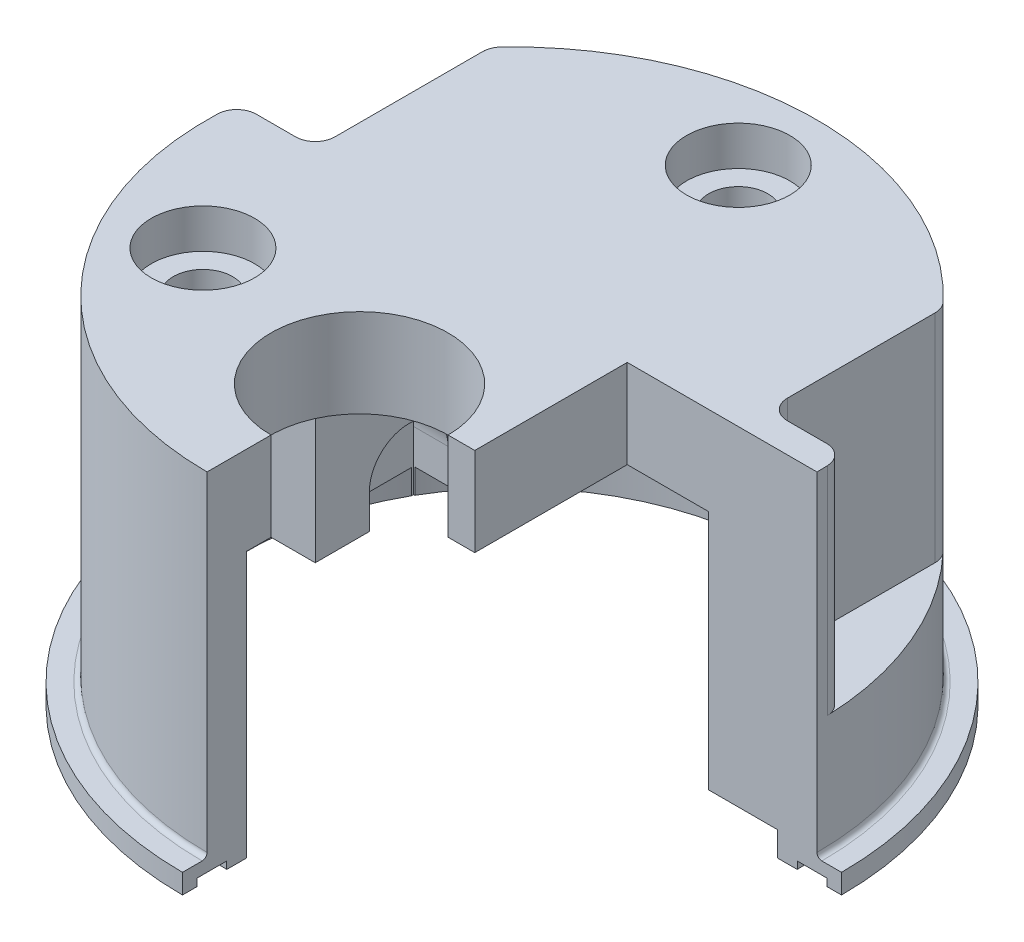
ISO-10303-21;
HEADER;
FILE_DESCRIPTION(('STEP AP214'),'2;1');
FILE_NAME('part.step','',(''),(''),'','','');
FILE_SCHEMA(('AUTOMOTIVE_DESIGN { 1 0 10303 214 1 1 1 1 }'));
ENDSEC;
DATA;
#1=APPLICATION_CONTEXT('core data for automotive mechanical design processes');
#2=APPLICATION_PROTOCOL_DEFINITION('international standard','automotive_design',2000,#1);
#3=PRODUCT_CONTEXT('',#1,'mechanical');
#4=PRODUCT('Part','Part','',(#3));
#5=PRODUCT_RELATED_PRODUCT_CATEGORY('part','',(#4));
#6=PRODUCT_DEFINITION_FORMATION('','',#4);
#7=PRODUCT_DEFINITION_CONTEXT('part definition',#1,'design');
#8=PRODUCT_DEFINITION('design','',#6,#7);
#9=PRODUCT_DEFINITION_SHAPE('','',#8);
#10=(LENGTH_UNIT() NAMED_UNIT(*) SI_UNIT(.MILLI.,.METRE.));
#11=(NAMED_UNIT(*) PLANE_ANGLE_UNIT() SI_UNIT($,.RADIAN.));
#12=(NAMED_UNIT(*) SI_UNIT($,.STERADIAN.) SOLID_ANGLE_UNIT());
#13=UNCERTAINTY_MEASURE_WITH_UNIT(LENGTH_MEASURE(1.E-05),#10,'distance_accuracy_value','');
#14=(GEOMETRIC_REPRESENTATION_CONTEXT(3) GLOBAL_UNCERTAINTY_ASSIGNED_CONTEXT((#13)) GLOBAL_UNIT_ASSIGNED_CONTEXT((#10,
#11,#12)) REPRESENTATION_CONTEXT('',''));
#15=CARTESIAN_POINT('',(0.,0.,0.));
#16=DIRECTION('',(0.,0.,1.));
#17=DIRECTION('',(1.,0.,0.));
#18=AXIS2_PLACEMENT_3D('',#15,#16,#17);
#19=CARTESIAN_POINT('',(0.,77.2968960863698,0.));
#20=DIRECTION('',(0.,1.,0.));
#21=DIRECTION('',(0.,0.,1.));
#22=AXIS2_PLACEMENT_3D('',#19,#20,#21);
#23=CYLINDRICAL_SURFACE('',#22,27.);
#24=CARTESIAN_POINT('',(0.,27.,0.));
#25=DIRECTION('',(0.,1.,0.));
#26=DIRECTION('',(0.,0.,1.));
#27=AXIS2_PLACEMENT_3D('',#24,#25,#26);
#28=CIRCLE('',#27,27.);
#29=CARTESIAN_POINT('',(-27.,27.,0.));
#30=VERTEX_POINT('',#29);
#31=CARTESIAN_POINT('',(0.,27.,27.));
#32=VERTEX_POINT('',#31);
#33=EDGE_CURVE('E575',#30,#32,#28,.T.);
#34=ORIENTED_EDGE('',*,*,#33,.T.);
#35=DIRECTION('',(0.,1.,0.));
#36=VECTOR('',#35,1.);
#37=CARTESIAN_POINT('',(0.,77.2968960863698,27.));
#38=LINE('',#37,#36);
#39=CARTESIAN_POINT('',(0.,0.,27.));
#40=VERTEX_POINT('',#39);
#41=EDGE_CURVE('E391',#32,#40,#38,.F.);
#42=ORIENTED_EDGE('',*,*,#41,.T.);
#43=CARTESIAN_POINT('',(0.,0.,0.));
#44=DIRECTION('',(0.,1.,0.));
#45=DIRECTION('',(0.,0.,1.));
#46=AXIS2_PLACEMENT_3D('',#43,#44,#45);
#47=CIRCLE('',#46,27.);
#48=CARTESIAN_POINT('',(-23.5,0.,-13.2947358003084));
#49=VERTEX_POINT('',#48);
#50=EDGE_CURVE('E567',#49,#40,#47,.T.);
#51=ORIENTED_EDGE('',*,*,#50,.F.);
#52=DIRECTION('',(0.,1.,0.));
#53=VECTOR('',#52,1.);
#54=CARTESIAN_POINT('',(-23.5,77.2968960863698,-13.2947358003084));
#55=LINE('',#54,#53);
#56=CARTESIAN_POINT('',(-23.5,2.49999999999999,-13.2947358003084));
#57=VERTEX_POINT('',#56);
#58=EDGE_CURVE('E474',#57,#49,#55,.F.);
#59=ORIENTED_EDGE('',*,*,#58,.F.);
#60=CARTESIAN_POINT('',(0.,2.49999999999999,0.));
#61=DIRECTION('',(0.,-1.,0.));
#62=DIRECTION('',(0.,0.,-1.));
#63=AXIS2_PLACEMENT_3D('',#60,#61,#62);
#64=CIRCLE('',#63,27.);
#65=CARTESIAN_POINT('',(-27.,2.49999999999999,0.));
#66=VERTEX_POINT('',#65);
#67=EDGE_CURVE('E579',#57,#66,#64,.F.);
#68=ORIENTED_EDGE('',*,*,#67,.T.);
#69=DIRECTION('',(0.,1.,0.));
#70=VECTOR('',#69,1.);
#71=CARTESIAN_POINT('',(-27.,77.2968960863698,0.));
#72=LINE('',#71,#70);
#73=EDGE_CURVE('E511',#66,#30,#72,.T.);
#74=ORIENTED_EDGE('',*,*,#73,.T.);
#75=EDGE_LOOP('',(#34,#42,#51,#59,#68,#74));
#76=FACE_BOUND('',#75,.T.);
#77=ADVANCED_FACE('F32',(#76),#23,.F.);
#78=CARTESIAN_POINT('',(-19.9185842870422,-464.,11.4999999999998));
#79=DIRECTION('',(0.,1.,0.));
#80=DIRECTION('',(0.,0.,1.));
#81=AXIS2_PLACEMENT_3D('',#78,#79,#80);
#82=CYLINDRICAL_SURFACE('',#81,3.);
#83=CARTESIAN_POINT('',(-19.9185842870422,27.,11.4999999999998));
#84=DIRECTION('',(0.,1.,0.));
#85=DIRECTION('',(0.,0.,1.));
#86=AXIS2_PLACEMENT_3D('',#83,#84,#85);
#87=CIRCLE('',#86,3.);
#88=CARTESIAN_POINT('',(-19.9185842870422,27.,14.4999999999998));
#89=VERTEX_POINT('',#88);
#90=EDGE_CURVE('E418',#89,#89,#87,.T.);
#91=ORIENTED_EDGE('',*,*,#90,.F.);
#92=EDGE_LOOP('',(#91));
#93=FACE_BOUND('',#92,.T.);
#94=CARTESIAN_POINT('',(-19.9185842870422,32.,11.4999999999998));
#95=DIRECTION('',(0.,1.,0.));
#96=DIRECTION('',(0.,0.,1.));
#97=AXIS2_PLACEMENT_3D('',#94,#95,#96);
#98=CIRCLE('',#97,3.);
#99=CARTESIAN_POINT('',(-19.9185842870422,32.,14.4999999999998));
#100=VERTEX_POINT('',#99);
#101=EDGE_CURVE('E410',#100,#100,#98,.F.);
#102=ORIENTED_EDGE('',*,*,#101,.F.);
#103=EDGE_LOOP('',(#102));
#104=FACE_BOUND('',#103,.T.);
#105=ADVANCED_FACE('F722',(#93,#104),#82,.F.);
#106=CARTESIAN_POINT('',(0.,-464.,-23.));
#107=DIRECTION('',(0.,1.,0.));
#108=DIRECTION('',(0.,0.,1.));
#109=AXIS2_PLACEMENT_3D('',#106,#107,#108);
#110=CYLINDRICAL_SURFACE('',#109,3.);
#111=CARTESIAN_POINT('',(0.,27.,-23.));
#112=DIRECTION('',(0.,1.,0.));
#113=DIRECTION('',(0.,0.,1.));
#114=AXIS2_PLACEMENT_3D('',#111,#112,#113);
#115=CIRCLE('',#114,3.);
#116=CARTESIAN_POINT('',(0.,27.,-20.));
#117=VERTEX_POINT('',#116);
#118=EDGE_CURVE('E421',#117,#117,#115,.T.);
#119=ORIENTED_EDGE('',*,*,#118,.F.);
#120=EDGE_LOOP('',(#119));
#121=FACE_BOUND('',#120,.T.);
#122=CARTESIAN_POINT('',(0.,32.,-23.));
#123=DIRECTION('',(0.,1.,0.));
#124=DIRECTION('',(0.,0.,1.));
#125=AXIS2_PLACEMENT_3D('',#122,#123,#124);
#126=CIRCLE('',#125,3.);
#127=CARTESIAN_POINT('',(0.,32.,-20.));
#128=VERTEX_POINT('',#127);
#129=EDGE_CURVE('E417',#128,#128,#126,.F.);
#130=ORIENTED_EDGE('',*,*,#129,.F.);
#131=EDGE_LOOP('',(#130));
#132=FACE_BOUND('',#131,.T.);
#133=ADVANCED_FACE('F729',(#121,#132),#110,.F.);
#134=CARTESIAN_POINT('',(27.,0.,0.));
#135=VERTEX_POINT('',#134);
#136=CARTESIAN_POINT('',(23.5,0.,-13.2947358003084));
#137=VERTEX_POINT('',#136);
#138=EDGE_CURVE('E566',#135,#137,#47,.T.);
#139=ORIENTED_EDGE('',*,*,#138,.F.);
#140=DIRECTION('',(0.,1.,0.));
#141=VECTOR('',#140,1.);
#142=CARTESIAN_POINT('',(27.,77.2968960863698,0.));
#143=LINE('',#142,#141);
#144=CARTESIAN_POINT('',(27.,2.49999999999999,0.));
#145=VERTEX_POINT('',#144);
#146=EDGE_CURVE('E365',#135,#145,#143,.T.);
#147=ORIENTED_EDGE('',*,*,#146,.T.);
#148=CARTESIAN_POINT('',(0.,2.49999999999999,0.));
#149=DIRECTION('',(0.,1.,0.));
#150=DIRECTION('',(0.,0.,1.));
#151=AXIS2_PLACEMENT_3D('',#148,#149,#150);
#152=CIRCLE('',#151,27.);
#153=CARTESIAN_POINT('',(23.5,2.49999999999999,-13.2947358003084));
#154=VERTEX_POINT('',#153);
#155=EDGE_CURVE('E574',#154,#145,#152,.F.);
#156=ORIENTED_EDGE('',*,*,#155,.F.);
#157=DIRECTION('',(0.,1.,0.));
#158=VECTOR('',#157,1.);
#159=CARTESIAN_POINT('',(23.5,77.2968960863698,-13.2947358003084));
#160=LINE('',#159,#158);
#161=EDGE_CURVE('E478',#154,#137,#160,.F.);
#162=ORIENTED_EDGE('',*,*,#161,.T.);
#163=EDGE_LOOP('',(#139,#147,#156,#162));
#164=FACE_BOUND('',#163,.T.);
#165=ADVANCED_FACE('F724',(#164),#23,.F.);
#166=CARTESIAN_POINT('',(0.,2.49999999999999,0.));
#167=DIRECTION('',(0.,1.,0.));
#168=DIRECTION('',(0.,0.,1.));
#169=AXIS2_PLACEMENT_3D('',#166,#167,#168);
#170=PLANE('',#169);
#171=CARTESIAN_POINT('',(20.,2.49999999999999,-18.1383571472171));
#172=VERTEX_POINT('',#171);
#173=CARTESIAN_POINT('',(23.3826859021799,2.49999999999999,-13.5));
#174=VERTEX_POINT('',#173);
#175=EDGE_CURVE('E576',#172,#174,#152,.F.);
#176=ORIENTED_EDGE('',*,*,#175,.T.);
#177=DIRECTION('',(-1.,0.,0.));
#178=VECTOR('',#177,1.);
#179=CARTESIAN_POINT('',(0.,2.49999999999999,-13.5));
#180=LINE('',#179,#178);
#181=CARTESIAN_POINT('',(20.,2.49999999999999,-13.5));
#182=VERTEX_POINT('',#181);
#183=EDGE_CURVE('E466',#174,#182,#180,.T.);
#184=ORIENTED_EDGE('',*,*,#183,.T.);
#185=DIRECTION('',(0.,0.,1.));
#186=VECTOR('',#185,1.);
#187=CARTESIAN_POINT('',(20.,2.49999999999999,-23.5299175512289));
#188=LINE('',#187,#186);
#189=EDGE_CURVE('E525',#172,#182,#188,.T.);
#190=ORIENTED_EDGE('',*,*,#189,.F.);
#191=EDGE_LOOP('',(#176,#184,#190));
#192=FACE_BOUND('',#191,.T.);
#193=ADVANCED_FACE('F735',(#192),#170,.F.);
#194=CARTESIAN_POINT('',(0.,2.49999999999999,0.));
#195=DIRECTION('',(0.,-1.,0.));
#196=DIRECTION('',(0.,0.,-1.));
#197=AXIS2_PLACEMENT_3D('',#194,#195,#196);
#198=PLANE('',#197);
#199=DIRECTION('',(1.,0.,0.));
#200=VECTOR('',#199,1.);
#201=CARTESIAN_POINT('',(0.,2.49999999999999,-13.5));
#202=LINE('',#201,#200);
#203=CARTESIAN_POINT('',(-23.3826859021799,2.49999999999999,-13.5));
#204=VERTEX_POINT('',#203);
#205=CARTESIAN_POINT('',(-20.,2.49999999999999,-13.5));
#206=VERTEX_POINT('',#205);
#207=EDGE_CURVE('E455',#204,#206,#202,.T.);
#208=ORIENTED_EDGE('',*,*,#207,.F.);
#209=CARTESIAN_POINT('',(-20.,2.49999999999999,-18.1383571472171));
#210=VERTEX_POINT('',#209);
#211=EDGE_CURVE('E580',#210,#204,#64,.F.);
#212=ORIENTED_EDGE('',*,*,#211,.F.);
#213=DIRECTION('',(0.,0.,-1.));
#214=VECTOR('',#213,1.);
#215=CARTESIAN_POINT('',(-20.,2.49999999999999,-23.5299175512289));
#216=LINE('',#215,#214);
#217=EDGE_CURVE('E502',#206,#210,#216,.T.);
#218=ORIENTED_EDGE('',*,*,#217,.F.);
#219=EDGE_LOOP('',(#208,#212,#218));
#220=FACE_BOUND('',#219,.T.);
#221=ADVANCED_FACE('F746',(#220),#198,.T.);
#222=CARTESIAN_POINT('',(27.,27.,0.));
#223=DIRECTION('',(0.,1.,0.));
#224=DIRECTION('',(0.,0.,1.));
#225=AXIS2_PLACEMENT_3D('',#222,#223,#224);
#226=PLANE('',#225);
#227=ORIENTED_EDGE('',*,*,#90,.T.);
#228=EDGE_LOOP('',(#227));
#229=FACE_BOUND('',#228,.T.);
#230=ORIENTED_EDGE('',*,*,#118,.T.);
#231=EDGE_LOOP('',(#230));
#232=FACE_BOUND('',#231,.T.);
#233=CARTESIAN_POINT('',(0.,27.,15.5));
#234=DIRECTION('',(0.,1.,0.));
#235=DIRECTION('',(0.,0.,1.));
#236=AXIS2_PLACEMENT_3D('',#233,#234,#235);
#237=CIRCLE('',#236,9.);
#238=CARTESIAN_POINT('',(9.,27.,15.5));
#239=VERTEX_POINT('',#238);
#240=CARTESIAN_POINT('',(0.,27.,24.5));
#241=VERTEX_POINT('',#240);
#242=EDGE_CURVE('E541',#239,#241,#237,.T.);
#243=ORIENTED_EDGE('',*,*,#242,.T.);
#244=DIRECTION('',(0.,0.,1.));
#245=VECTOR('',#244,1.);
#246=CARTESIAN_POINT('',(0.,27.,0.));
#247=LINE('',#246,#245);
#248=EDGE_CURVE('E394',#241,#32,#247,.T.);
#249=ORIENTED_EDGE('',*,*,#248,.T.);
#250=ORIENTED_EDGE('',*,*,#33,.F.);
#251=DIRECTION('',(1.,0.,0.));
#252=VECTOR('',#251,1.);
#253=CARTESIAN_POINT('',(27.,27.,0.));
#254=LINE('',#253,#252);
#255=CARTESIAN_POINT('',(-20.,27.,0.));
#256=VERTEX_POINT('',#255);
#257=EDGE_CURVE('E514',#30,#256,#254,.T.);
#258=ORIENTED_EDGE('',*,*,#257,.T.);
#259=DIRECTION('',(0.,0.,-1.));
#260=VECTOR('',#259,1.);
#261=CARTESIAN_POINT('',(-20.,27.,0.));
#262=LINE('',#261,#260);
#263=CARTESIAN_POINT('',(-20.,27.,-18.1383571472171));
#264=VERTEX_POINT('',#263);
#265=EDGE_CURVE('E520',#256,#264,#262,.T.);
#266=ORIENTED_EDGE('',*,*,#265,.T.);
#267=CARTESIAN_POINT('',(20.,27.,-18.1383571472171));
#268=VERTEX_POINT('',#267);
#269=EDGE_CURVE('E571',#268,#264,#28,.T.);
#270=ORIENTED_EDGE('',*,*,#269,.F.);
#271=DIRECTION('',(0.,0.,1.));
#272=VECTOR('',#271,1.);
#273=CARTESIAN_POINT('',(20.,27.,0.));
#274=LINE('',#273,#272);
#275=CARTESIAN_POINT('',(20.,27.,0.));
#276=VERTEX_POINT('',#275);
#277=EDGE_CURVE('E535',#268,#276,#274,.T.);
#278=ORIENTED_EDGE('',*,*,#277,.T.);
#279=DIRECTION('',(-1.,0.,0.));
#280=VECTOR('',#279,1.);
#281=CARTESIAN_POINT('',(27.,27.,0.));
#282=LINE('',#281,#280);
#283=CARTESIAN_POINT('',(11.7155668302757,27.,0.));
#284=VERTEX_POINT('',#283);
#285=EDGE_CURVE('E367',#276,#284,#282,.T.);
#286=ORIENTED_EDGE('',*,*,#285,.T.);
#287=DIRECTION('',(0.,0.,1.));
#288=VECTOR('',#287,1.);
#289=CARTESIAN_POINT('',(11.7155668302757,27.,0.));
#290=LINE('',#289,#288);
#291=CARTESIAN_POINT('',(11.7155668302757,27.,15.5));
#292=VERTEX_POINT('',#291);
#293=EDGE_CURVE('E321',#284,#292,#290,.T.);
#294=ORIENTED_EDGE('',*,*,#293,.T.);
#295=DIRECTION('',(-1.,0.,0.));
#296=VECTOR('',#295,1.);
#297=CARTESIAN_POINT('',(27.,27.,15.5));
#298=LINE('',#297,#296);
#299=EDGE_CURVE('E400',#292,#239,#298,.T.);
#300=ORIENTED_EDGE('',*,*,#299,.T.);
#301=EDGE_LOOP('',(#243,#249,#250,#258,#266,#270,#278,#286,#294,#300));
#302=FACE_BOUND('',#301,.T.);
#303=ADVANCED_FACE('F34',(#229,#232,#302),#226,.F.);
#304=ORIENTED_EDGE('',*,*,#211,.T.);
#305=DIRECTION('',(0.,1.,0.));
#306=VECTOR('',#305,1.);
#307=CARTESIAN_POINT('',(-23.3826859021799,77.2968960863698,-13.5));
#308=LINE('',#307,#306);
#309=CARTESIAN_POINT('',(-23.3826859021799,0.,-13.5));
#310=VERTEX_POINT('',#309);
#311=EDGE_CURVE('E457',#204,#310,#308,.F.);
#312=ORIENTED_EDGE('',*,*,#311,.T.);
#313=CARTESIAN_POINT('',(23.3826859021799,0.,-13.5));
#314=VERTEX_POINT('',#313);
#315=EDGE_CURVE('E570',#314,#310,#47,.T.);
#316=ORIENTED_EDGE('',*,*,#315,.F.);
#317=DIRECTION('',(0.,1.,0.));
#318=VECTOR('',#317,1.);
#319=CARTESIAN_POINT('',(23.3826859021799,77.2968960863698,-13.5));
#320=LINE('',#319,#318);
#321=EDGE_CURVE('E469',#314,#174,#320,.T.);
#322=ORIENTED_EDGE('',*,*,#321,.T.);
#323=ORIENTED_EDGE('',*,*,#175,.F.);
#324=DIRECTION('',(0.,1.,0.));
#325=VECTOR('',#324,1.);
#326=CARTESIAN_POINT('',(20.,77.2968960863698,-18.1383571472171));
#327=LINE('',#326,#325);
#328=EDGE_CURVE('E533',#172,#268,#327,.T.);
#329=ORIENTED_EDGE('',*,*,#328,.T.);
#330=ORIENTED_EDGE('',*,*,#269,.T.);
#331=DIRECTION('',(0.,1.,0.));
#332=VECTOR('',#331,1.);
#333=CARTESIAN_POINT('',(-20.,77.2968960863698,-18.1383571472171));
#334=LINE('',#333,#332);
#335=EDGE_CURVE('E517',#264,#210,#334,.F.);
#336=ORIENTED_EDGE('',*,*,#335,.T.);
#337=EDGE_LOOP('',(#304,#312,#316,#322,#323,#329,#330,#336));
#338=FACE_BOUND('',#337,.T.);
#339=ADVANCED_FACE('F725',(#338),#23,.F.);
#340=CARTESIAN_POINT('',(29.,0.,0.));
#341=DIRECTION('',(0.,1.,0.));
#342=DIRECTION('',(0.,0.,1.));
#343=AXIS2_PLACEMENT_3D('',#340,#341,#342);
#344=PLANE('',#343);
#345=ORIENTED_EDGE('',*,*,#50,.T.);
#346=DIRECTION('',(0.,0.,1.));
#347=VECTOR('',#346,1.);
#348=CARTESIAN_POINT('',(0.,0.,0.));
#349=LINE('',#348,#347);
#350=CARTESIAN_POINT('',(0.,0.,29.));
#351=VERTEX_POINT('',#350);
#352=EDGE_CURVE('E388',#40,#351,#349,.T.);
#353=ORIENTED_EDGE('',*,*,#352,.T.);
#354=CARTESIAN_POINT('',(0.,0.,0.));
#355=DIRECTION('',(0.,1.,0.));
#356=DIRECTION('',(0.,0.,1.));
#357=AXIS2_PLACEMENT_3D('',#354,#355,#356);
#358=CIRCLE('',#357,29.);
#359=CARTESIAN_POINT('',(29.,0.,0.));
#360=VERTEX_POINT('',#359);
#361=EDGE_CURVE('E563',#360,#351,#358,.T.);
#362=ORIENTED_EDGE('',*,*,#361,.F.);
#363=DIRECTION('',(-1.,0.,0.));
#364=VECTOR('',#363,1.);
#365=CARTESIAN_POINT('',(29.,0.,0.));
#366=LINE('',#365,#364);
#367=EDGE_CURVE('E362',#360,#135,#366,.T.);
#368=ORIENTED_EDGE('',*,*,#367,.T.);
#369=ORIENTED_EDGE('',*,*,#138,.T.);
#370=DIRECTION('',(0.,0.,-1.));
#371=VECTOR('',#370,1.);
#372=CARTESIAN_POINT('',(23.5,0.,0.));
#373=LINE('',#372,#371);
#374=CARTESIAN_POINT('',(23.5,0.,-13.5));
#375=VERTEX_POINT('',#374);
#376=EDGE_CURVE('E481',#137,#375,#373,.T.);
#377=ORIENTED_EDGE('',*,*,#376,.T.);
#378=DIRECTION('',(-1.,0.,0.));
#379=VECTOR('',#378,1.);
#380=CARTESIAN_POINT('',(29.,0.,-13.5));
#381=LINE('',#380,#379);
#382=EDGE_CURVE('E464',#375,#314,#381,.T.);
#383=ORIENTED_EDGE('',*,*,#382,.T.);
#384=ORIENTED_EDGE('',*,*,#315,.T.);
#385=CARTESIAN_POINT('',(-23.5,0.,-13.5));
#386=VERTEX_POINT('',#385);
#387=EDGE_CURVE('E460',#310,#386,#381,.T.);
#388=ORIENTED_EDGE('',*,*,#387,.T.);
#389=DIRECTION('',(0.,0.,-1.));
#390=VECTOR('',#389,1.);
#391=CARTESIAN_POINT('',(-23.5,0.,0.));
#392=LINE('',#391,#390);
#393=EDGE_CURVE('E476',#49,#386,#392,.T.);
#394=ORIENTED_EDGE('',*,*,#393,.F.);
#395=EDGE_LOOP('',(#345,#353,#362,#368,#369,#377,#383,#384,#388,#394));
#396=FACE_BOUND('',#395,.T.);
#397=ADVANCED_FACE('F738',(#396),#344,.F.);
#398=CARTESIAN_POINT('',(0.,77.2968960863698,0.));
#399=DIRECTION('',(0.,1.,0.));
#400=DIRECTION('',(0.,0.,1.));
#401=AXIS2_PLACEMENT_3D('',#398,#399,#400);
#402=CYLINDRICAL_SURFACE('',#401,29.);
#403=ORIENTED_EDGE('',*,*,#361,.T.);
#404=DIRECTION('',(0.,1.,0.));
#405=VECTOR('',#404,1.);
#406=CARTESIAN_POINT('',(0.,77.2968960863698,29.));
#407=LINE('',#406,#405);
#408=CARTESIAN_POINT('',(0.,0.750000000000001,29.));
#409=VERTEX_POINT('',#408);
#410=EDGE_CURVE('E385',#351,#409,#407,.T.);
#411=ORIENTED_EDGE('',*,*,#410,.T.);
#412=CARTESIAN_POINT('',(0.,0.750000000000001,0.));
#413=DIRECTION('',(0.,1.,0.));
#414=DIRECTION('',(0.,0.,1.));
#415=AXIS2_PLACEMENT_3D('',#412,#413,#414);
#416=CIRCLE('',#415,29.);
#417=CARTESIAN_POINT('',(29.,0.750000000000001,0.));
#418=VERTEX_POINT('',#417);
#419=EDGE_CURVE('E560',#418,#409,#416,.T.);
#420=ORIENTED_EDGE('',*,*,#419,.F.);
#421=DIRECTION('',(0.,1.,0.));
#422=VECTOR('',#421,1.);
#423=CARTESIAN_POINT('',(29.,77.2968960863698,0.));
#424=LINE('',#423,#422);
#425=EDGE_CURVE('E359',#418,#360,#424,.F.);
#426=ORIENTED_EDGE('',*,*,#425,.T.);
#427=EDGE_LOOP('',(#403,#411,#420,#426));
#428=FACE_BOUND('',#427,.T.);
#429=ADVANCED_FACE('F744',(#428),#402,.T.);
#430=CARTESIAN_POINT('',(32.,0.75,0.));
#431=DIRECTION('',(0.,1.,0.));
#432=DIRECTION('',(0.,0.,1.));
#433=AXIS2_PLACEMENT_3D('',#430,#431,#432);
#434=PLANE('',#433);
#435=ORIENTED_EDGE('',*,*,#419,.T.);
#436=DIRECTION('',(0.,0.,1.));
#437=VECTOR('',#436,1.);
#438=CARTESIAN_POINT('',(0.,0.75,0.));
#439=LINE('',#438,#437);
#440=CARTESIAN_POINT('',(0.,0.750000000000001,32.));
#441=VERTEX_POINT('',#440);
#442=EDGE_CURVE('E382',#409,#441,#439,.T.);
#443=ORIENTED_EDGE('',*,*,#442,.T.);
#444=CARTESIAN_POINT('',(0.,0.750000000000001,0.));
#445=DIRECTION('',(0.,1.,0.));
#446=DIRECTION('',(0.,0.,1.));
#447=AXIS2_PLACEMENT_3D('',#444,#445,#446);
#448=CIRCLE('',#447,32.);
#449=CARTESIAN_POINT('',(32.,0.750000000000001,0.));
#450=VERTEX_POINT('',#449);
#451=EDGE_CURVE('E557',#450,#441,#448,.T.);
#452=ORIENTED_EDGE('',*,*,#451,.F.);
#453=DIRECTION('',(-1.,0.,0.));
#454=VECTOR('',#453,1.);
#455=CARTESIAN_POINT('',(32.,0.75,0.));
#456=LINE('',#455,#454);
#457=EDGE_CURVE('E356',#450,#418,#456,.T.);
#458=ORIENTED_EDGE('',*,*,#457,.T.);
#459=EDGE_LOOP('',(#435,#443,#452,#458));
#460=FACE_BOUND('',#459,.T.);
#461=ADVANCED_FACE('F823',(#460),#434,.F.);
#462=CARTESIAN_POINT('',(0.,77.2968960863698,0.));
#463=DIRECTION('',(0.,1.,0.));
#464=DIRECTION('',(0.,0.,1.));
#465=AXIS2_PLACEMENT_3D('',#462,#463,#464);
#466=CYLINDRICAL_SURFACE('',#465,32.);
#467=ORIENTED_EDGE('',*,*,#451,.T.);
#468=DIRECTION('',(0.,1.,0.));
#469=VECTOR('',#468,1.);
#470=CARTESIAN_POINT('',(0.,77.2968960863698,32.));
#471=LINE('',#470,#469);
#472=CARTESIAN_POINT('',(0.,0.,32.));
#473=VERTEX_POINT('',#472);
#474=EDGE_CURVE('E379',#441,#473,#471,.F.);
#475=ORIENTED_EDGE('',*,*,#474,.T.);
#476=CARTESIAN_POINT('',(0.,0.,0.));
#477=DIRECTION('',(0.,1.,0.));
#478=DIRECTION('',(0.,0.,1.));
#479=AXIS2_PLACEMENT_3D('',#476,#477,#478);
#480=CIRCLE('',#479,32.);
#481=CARTESIAN_POINT('',(32.,0.,0.));
#482=VERTEX_POINT('',#481);
#483=EDGE_CURVE('E554',#482,#473,#480,.T.);
#484=ORIENTED_EDGE('',*,*,#483,.F.);
#485=DIRECTION('',(0.,1.,0.));
#486=VECTOR('',#485,1.);
#487=CARTESIAN_POINT('',(32.,77.2968960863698,0.));
#488=LINE('',#487,#486);
#489=EDGE_CURVE('E353',#482,#450,#488,.T.);
#490=ORIENTED_EDGE('',*,*,#489,.T.);
#491=EDGE_LOOP('',(#467,#475,#484,#490));
#492=FACE_BOUND('',#491,.T.);
#493=ADVANCED_FACE('F825',(#492),#466,.F.);
#494=CARTESIAN_POINT('',(33.5,0.,0.));
#495=DIRECTION('',(0.,1.,0.));
#496=DIRECTION('',(0.,0.,1.));
#497=AXIS2_PLACEMENT_3D('',#494,#495,#496);
#498=PLANE('',#497);
#499=ORIENTED_EDGE('',*,*,#483,.T.);
#500=DIRECTION('',(0.,0.,1.));
#501=VECTOR('',#500,1.);
#502=CARTESIAN_POINT('',(0.,0.,0.));
#503=LINE('',#502,#501);
#504=CARTESIAN_POINT('',(0.,0.,33.5));
#505=VERTEX_POINT('',#504);
#506=EDGE_CURVE('E376',#473,#505,#503,.T.);
#507=ORIENTED_EDGE('',*,*,#506,.T.);
#508=CARTESIAN_POINT('',(0.,0.,0.));
#509=DIRECTION('',(0.,1.,0.));
#510=DIRECTION('',(0.,0.,1.));
#511=AXIS2_PLACEMENT_3D('',#508,#509,#510);
#512=CIRCLE('',#511,33.5);
#513=CARTESIAN_POINT('',(33.5,0.,0.));
#514=VERTEX_POINT('',#513);
#515=EDGE_CURVE('E551',#514,#505,#512,.T.);
#516=ORIENTED_EDGE('',*,*,#515,.F.);
#517=DIRECTION('',(-1.,0.,0.));
#518=VECTOR('',#517,1.);
#519=CARTESIAN_POINT('',(33.5,0.,0.));
#520=LINE('',#519,#518);
#521=EDGE_CURVE('E350',#514,#482,#520,.T.);
#522=ORIENTED_EDGE('',*,*,#521,.T.);
#523=EDGE_LOOP('',(#499,#507,#516,#522));
#524=FACE_BOUND('',#523,.T.);
#525=ADVANCED_FACE('F829',(#524),#498,.F.);
#526=CARTESIAN_POINT('',(0.,77.2968960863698,0.));
#527=DIRECTION('',(0.,1.,0.));
#528=DIRECTION('',(0.,0.,1.));
#529=AXIS2_PLACEMENT_3D('',#526,#527,#528);
#530=CYLINDRICAL_SURFACE('',#529,33.5);
#531=ORIENTED_EDGE('',*,*,#515,.T.);
#532=DIRECTION('',(0.,1.,0.));
#533=VECTOR('',#532,1.);
#534=CARTESIAN_POINT('',(0.,77.2968960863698,33.5));
#535=LINE('',#534,#533);
#536=CARTESIAN_POINT('',(0.,2.,33.5));
#537=VERTEX_POINT('',#536);
#538=EDGE_CURVE('E373',#505,#537,#535,.T.);
#539=ORIENTED_EDGE('',*,*,#538,.T.);
#540=CARTESIAN_POINT('',(0.,2.,0.));
#541=DIRECTION('',(0.,1.,0.));
#542=DIRECTION('',(0.,0.,1.));
#543=AXIS2_PLACEMENT_3D('',#540,#541,#542);
#544=CIRCLE('',#543,33.5);
#545=CARTESIAN_POINT('',(33.5,2.,0.));
#546=VERTEX_POINT('',#545);
#547=EDGE_CURVE('E547',#546,#537,#544,.T.);
#548=ORIENTED_EDGE('',*,*,#547,.F.);
#549=DIRECTION('',(0.,1.,0.));
#550=VECTOR('',#549,1.);
#551=CARTESIAN_POINT('',(33.5,77.2968960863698,0.));
#552=LINE('',#551,#550);
#553=EDGE_CURVE('E347',#546,#514,#552,.F.);
#554=ORIENTED_EDGE('',*,*,#553,.T.);
#555=EDGE_LOOP('',(#531,#539,#548,#554));
#556=FACE_BOUND('',#555,.T.);
#557=ADVANCED_FACE('F831',(#556),#530,.T.);
#558=CARTESIAN_POINT('',(31.,2.,0.));
#559=DIRECTION('',(0.,-1.,0.));
#560=DIRECTION('',(0.,0.,-1.));
#561=AXIS2_PLACEMENT_3D('',#558,#559,#560);
#562=PLANE('',#561);
#563=ORIENTED_EDGE('',*,*,#547,.T.);
#564=DIRECTION('',(0.,0.,-1.));
#565=VECTOR('',#564,1.);
#566=CARTESIAN_POINT('',(0.,2.,0.));
#567=LINE('',#566,#565);
#568=CARTESIAN_POINT('',(0.,2.,31.5));
#569=VERTEX_POINT('',#568);
#570=EDGE_CURVE('E370',#537,#569,#567,.T.);
#571=ORIENTED_EDGE('',*,*,#570,.T.);
#572=CARTESIAN_POINT('',(0.,2.,0.));
#573=DIRECTION('',(0.,-1.,0.));
#574=DIRECTION('',(0.,0.,-1.));
#575=AXIS2_PLACEMENT_3D('',#572,#573,#574);
#576=CIRCLE('',#575,31.5);
#577=CARTESIAN_POINT('',(31.5,2.,0.));
#578=VERTEX_POINT('',#577);
#579=EDGE_CURVE('E652',#569,#578,#576,.T.);
#580=ORIENTED_EDGE('',*,*,#579,.T.);
#581=DIRECTION('',(1.,0.,0.));
#582=VECTOR('',#581,1.);
#583=CARTESIAN_POINT('',(31.,2.,0.));
#584=LINE('',#583,#582);
#585=EDGE_CURVE('E55',#578,#546,#584,.T.);
#586=ORIENTED_EDGE('',*,*,#585,.T.);
#587=EDGE_LOOP('',(#563,#571,#580,#586));
#588=FACE_BOUND('',#587,.T.);
#589=ADVANCED_FACE('F834',(#588),#562,.F.);
#590=CARTESIAN_POINT('',(0.,77.2968960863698,0.));
#591=DIRECTION('',(0.,1.,0.));
#592=DIRECTION('',(0.,0.,1.));
#593=AXIS2_PLACEMENT_3D('',#590,#591,#592);
#594=CYLINDRICAL_SURFACE('',#593,31.);
#595=CARTESIAN_POINT('',(0.,2.5,0.));
#596=DIRECTION('',(0.,-1.,0.));
#597=DIRECTION('',(0.,0.,-1.));
#598=AXIS2_PLACEMENT_3D('',#595,#596,#597);
#599=CIRCLE('',#598,31.);
#600=CARTESIAN_POINT('',(31.,2.5,0.));
#601=VERTEX_POINT('',#600);
#602=CARTESIAN_POINT('',(0.,2.5,31.));
#603=VERTEX_POINT('',#602);
#604=EDGE_CURVE('E649',#601,#603,#599,.F.);
#605=ORIENTED_EDGE('',*,*,#604,.T.);
#606=DIRECTION('',(0.,1.,0.));
#607=VECTOR('',#606,1.);
#608=CARTESIAN_POINT('',(0.,77.2968960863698,31.));
#609=LINE('',#608,#607);
#610=CARTESIAN_POINT('',(0.,36.,31.));
#611=VERTEX_POINT('',#610);
#612=EDGE_CURVE('E47',#603,#611,#609,.T.);
#613=ORIENTED_EDGE('',*,*,#612,.T.);
#614=CARTESIAN_POINT('',(0.,36.,0.));
#615=DIRECTION('',(0.,1.,0.));
#616=DIRECTION('',(0.,0.,1.));
#617=AXIS2_PLACEMENT_3D('',#614,#615,#616);
#618=CIRCLE('',#617,31.);
#619=CARTESIAN_POINT('',(-30.9815640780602,36.,-1.06896551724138));
#620=VERTEX_POINT('',#619);
#621=EDGE_CURVE('E545',#620,#611,#618,.T.);
#622=ORIENTED_EDGE('',*,*,#621,.F.);
#623=DIRECTION('',(0.,1.,0.));
#624=VECTOR('',#623,1.);
#625=CARTESIAN_POINT('',(-30.9815640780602,77.2968960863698,-1.06896551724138));
#626=LINE('',#625,#624);
#627=CARTESIAN_POINT('',(-30.9815640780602,14.,-1.06896551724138));
#628=VERTEX_POINT('',#627);
#629=EDGE_CURVE('E613',#620,#628,#626,.F.);
#630=ORIENTED_EDGE('',*,*,#629,.T.);
#631=CARTESIAN_POINT('',(0.,14.,0.));
#632=DIRECTION('',(0.,1.,0.));
#633=DIRECTION('',(0.,0.,1.));
#634=AXIS2_PLACEMENT_3D('',#631,#632,#633);
#635=CIRCLE('',#634,31.);
#636=CARTESIAN_POINT('',(-22.448275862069,14.,-21.3793103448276));
#637=VERTEX_POINT('',#636);
#638=EDGE_CURVE('E586',#637,#628,#635,.T.);
#639=ORIENTED_EDGE('',*,*,#638,.F.);
#640=DIRECTION('',(0.,1.,0.));
#641=VECTOR('',#640,1.);
#642=CARTESIAN_POINT('',(-22.448275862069,77.2968960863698,-21.3793103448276));
#643=LINE('',#642,#641);
#644=CARTESIAN_POINT('',(-22.448275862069,36.,-21.3793103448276));
#645=VERTEX_POINT('',#644);
#646=EDGE_CURVE('E610',#637,#645,#643,.T.);
#647=ORIENTED_EDGE('',*,*,#646,.T.);
#648=CARTESIAN_POINT('',(22.448275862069,36.,-21.3793103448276));
#649=VERTEX_POINT('',#648);
#650=EDGE_CURVE('E544',#649,#645,#618,.T.);
#651=ORIENTED_EDGE('',*,*,#650,.F.);
#652=DIRECTION('',(0.,1.,0.));
#653=VECTOR('',#652,1.);
#654=CARTESIAN_POINT('',(22.448275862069,77.2968960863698,-21.3793103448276));
#655=LINE('',#654,#653);
#656=CARTESIAN_POINT('',(22.448275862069,14.,-21.3793103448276));
#657=VERTEX_POINT('',#656);
#658=EDGE_CURVE('E607',#649,#657,#655,.F.);
#659=ORIENTED_EDGE('',*,*,#658,.T.);
#660=CARTESIAN_POINT('',(0.,14.,0.));
#661=DIRECTION('',(0.,-1.,0.));
#662=DIRECTION('',(0.,0.,-1.));
#663=AXIS2_PLACEMENT_3D('',#660,#661,#662);
#664=CIRCLE('',#663,31.);
#665=CARTESIAN_POINT('',(30.9815640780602,14.,-1.06896551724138));
#666=VERTEX_POINT('',#665);
#667=EDGE_CURVE('E591',#657,#666,#664,.T.);
#668=ORIENTED_EDGE('',*,*,#667,.T.);
#669=DIRECTION('',(0.,1.,0.));
#670=VECTOR('',#669,1.);
#671=CARTESIAN_POINT('',(30.9815640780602,77.2968960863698,-1.06896551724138));
#672=LINE('',#671,#670);
#673=CARTESIAN_POINT('',(30.9815640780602,36.,-1.06896551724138));
#674=VERTEX_POINT('',#673);
#675=EDGE_CURVE('E604',#666,#674,#672,.T.);
#676=ORIENTED_EDGE('',*,*,#675,.T.);
#677=CARTESIAN_POINT('',(31.,36.,0.));
#678=VERTEX_POINT('',#677);
#679=EDGE_CURVE('E548',#678,#674,#618,.T.);
#680=ORIENTED_EDGE('',*,*,#679,.F.);
#681=DIRECTION('',(0.,1.,0.));
#682=VECTOR('',#681,1.);
#683=CARTESIAN_POINT('',(31.,77.2968960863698,0.));
#684=LINE('',#683,#682);
#685=EDGE_CURVE('E331',#678,#601,#684,.F.);
#686=ORIENTED_EDGE('',*,*,#685,.T.);
#687=EDGE_LOOP('',(#605,#613,#622,#630,#639,#647,#651,#659,#668,#676,#680,#686));
#688=FACE_BOUND('',#687,.T.);
#689=ADVANCED_FACE('F679',(#688),#594,.T.);
#690=CARTESIAN_POINT('',(0.,36.,0.));
#691=DIRECTION('',(0.,-1.,0.));
#692=DIRECTION('',(0.,0.,-1.));
#693=AXIS2_PLACEMENT_3D('',#690,#691,#692);
#694=PLANE('',#693);
#695=CARTESIAN_POINT('',(-19.9185842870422,36.,11.4999999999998));
#696=DIRECTION('',(0.,1.,0.));
#697=DIRECTION('',(0.,0.,1.));
#698=AXIS2_PLACEMENT_3D('',#695,#696,#697);
#699=CIRCLE('',#698,5.25);
#700=CARTESIAN_POINT('',(-19.9185842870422,36.,16.7499999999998));
#701=VERTEX_POINT('',#700);
#702=EDGE_CURVE('E404',#701,#701,#699,.T.);
#703=ORIENTED_EDGE('',*,*,#702,.F.);
#704=EDGE_LOOP('',(#703));
#705=FACE_BOUND('',#704,.T.);
#706=CARTESIAN_POINT('',(0.,36.,-23.));
#707=DIRECTION('',(0.,1.,0.));
#708=DIRECTION('',(0.,0.,1.));
#709=AXIS2_PLACEMENT_3D('',#706,#707,#708);
#710=CIRCLE('',#709,5.25);
#711=CARTESIAN_POINT('',(0.,36.,-17.75));
#712=VERTEX_POINT('',#711);
#713=EDGE_CURVE('E411',#712,#712,#710,.T.);
#714=ORIENTED_EDGE('',*,*,#713,.F.);
#715=EDGE_LOOP('',(#714));
#716=FACE_BOUND('',#715,.T.);
#717=ORIENTED_EDGE('',*,*,#621,.T.);
#718=DIRECTION('',(0.,0.,1.));
#719=VECTOR('',#718,1.);
#720=CARTESIAN_POINT('',(0.,36.,43.4945463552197));
#721=LINE('',#720,#719);
#722=CARTESIAN_POINT('',(0.,36.,24.5));
#723=VERTEX_POINT('',#722);
#724=EDGE_CURVE('E324',#723,#611,#721,.T.);
#725=ORIENTED_EDGE('',*,*,#724,.F.);
#726=CARTESIAN_POINT('',(0.,36.,15.5));
#727=DIRECTION('',(0.,1.,0.));
#728=DIRECTION('',(0.,0.,1.));
#729=AXIS2_PLACEMENT_3D('',#726,#727,#728);
#730=CIRCLE('',#729,9.);
#731=CARTESIAN_POINT('',(9.,36.,15.5));
#732=VERTEX_POINT('',#731);
#733=EDGE_CURVE('E538',#732,#723,#730,.T.);
#734=ORIENTED_EDGE('',*,*,#733,.F.);
#735=DIRECTION('',(-1.,0.,0.));
#736=VECTOR('',#735,1.);
#737=CARTESIAN_POINT('',(0.,36.,15.5));
#738=LINE('',#737,#736);
#739=CARTESIAN_POINT('',(11.7155668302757,36.,15.5));
#740=VERTEX_POINT('',#739);
#741=EDGE_CURVE('E339',#740,#732,#738,.T.);
#742=ORIENTED_EDGE('',*,*,#741,.F.);
#743=DIRECTION('',(0.,0.,1.));
#744=VECTOR('',#743,1.);
#745=CARTESIAN_POINT('',(11.7155668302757,36.,15.5));
#746=LINE('',#745,#744);
#747=CARTESIAN_POINT('',(11.7155668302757,36.,0.));
#748=VERTEX_POINT('',#747);
#749=EDGE_CURVE('E318',#748,#740,#746,.T.);
#750=ORIENTED_EDGE('',*,*,#749,.F.);
#751=DIRECTION('',(-1.,0.,0.));
#752=VECTOR('',#751,1.);
#753=CARTESIAN_POINT('',(11.7155668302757,36.,0.));
#754=LINE('',#753,#752);
#755=EDGE_CURVE('E327',#678,#748,#754,.T.);
#756=ORIENTED_EDGE('',*,*,#755,.F.);
#757=ORIENTED_EDGE('',*,*,#679,.T.);
#758=CARTESIAN_POINT('',(28.9827534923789,36.,-1.));
#759=DIRECTION('',(0.,-1.,0.));
#760=DIRECTION('',(0.,0.,-1.));
#761=AXIS2_PLACEMENT_3D('',#758,#759,#760);
#762=CIRCLE('',#761,2.);
#763=CARTESIAN_POINT('',(28.9827534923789,36.,-3.));
#764=VERTEX_POINT('',#763);
#765=EDGE_CURVE('E616',#674,#764,#762,.F.);
#766=ORIENTED_EDGE('',*,*,#765,.T.);
#767=DIRECTION('',(1.,0.,0.));
#768=VECTOR('',#767,1.);
#769=CARTESIAN_POINT('',(23.,36.,-3.));
#770=LINE('',#769,#768);
#771=CARTESIAN_POINT('',(25.,36.,-3.));
#772=VERTEX_POINT('',#771);
#773=EDGE_CURVE('E484',#772,#764,#770,.T.);
#774=ORIENTED_EDGE('',*,*,#773,.F.);
#775=CARTESIAN_POINT('',(25.,36.,-5.));
#776=DIRECTION('',(0.,-1.,0.));
#777=DIRECTION('',(0.,0.,-1.));
#778=AXIS2_PLACEMENT_3D('',#775,#776,#777);
#779=CIRCLE('',#778,2.);
#780=CARTESIAN_POINT('',(23.,36.,-5.));
#781=VERTEX_POINT('',#780);
#782=EDGE_CURVE('E644',#772,#781,#779,.T.);
#783=ORIENTED_EDGE('',*,*,#782,.T.);
#784=DIRECTION('',(0.,0.,-1.));
#785=VECTOR('',#784,1.);
#786=CARTESIAN_POINT('',(23.,36.,0.));
#787=LINE('',#786,#785);
#788=CARTESIAN_POINT('',(23.,36.,-20.));
#789=VERTEX_POINT('',#788);
#790=EDGE_CURVE('E588',#781,#789,#787,.T.);
#791=ORIENTED_EDGE('',*,*,#790,.T.);
#792=CARTESIAN_POINT('',(21.,36.,-20.));
#793=DIRECTION('',(0.,-1.,0.));
#794=DIRECTION('',(0.,0.,-1.));
#795=AXIS2_PLACEMENT_3D('',#792,#793,#794);
#796=CIRCLE('',#795,2.);
#797=EDGE_CURVE('E618',#789,#649,#796,.F.);
#798=ORIENTED_EDGE('',*,*,#797,.T.);
#799=ORIENTED_EDGE('',*,*,#650,.T.);
#800=CARTESIAN_POINT('',(-21.,36.,-20.));
#801=DIRECTION('',(0.,-1.,0.));
#802=DIRECTION('',(0.,0.,-1.));
#803=AXIS2_PLACEMENT_3D('',#800,#801,#802);
#804=CIRCLE('',#803,2.);
#805=CARTESIAN_POINT('',(-23.,36.,-20.));
#806=VERTEX_POINT('',#805);
#807=EDGE_CURVE('E620',#645,#806,#804,.F.);
#808=ORIENTED_EDGE('',*,*,#807,.T.);
#809=DIRECTION('',(0.,0.,-1.));
#810=VECTOR('',#809,1.);
#811=CARTESIAN_POINT('',(-23.,36.,-3.));
#812=LINE('',#811,#810);
#813=CARTESIAN_POINT('',(-23.,36.,-5.));
#814=VERTEX_POINT('',#813);
#815=EDGE_CURVE('E493',#814,#806,#812,.T.);
#816=ORIENTED_EDGE('',*,*,#815,.F.);
#817=CARTESIAN_POINT('',(-25.,36.,-5.));
#818=DIRECTION('',(0.,-1.,0.));
#819=DIRECTION('',(0.,0.,-1.));
#820=AXIS2_PLACEMENT_3D('',#817,#818,#819);
#821=CIRCLE('',#820,2.);
#822=CARTESIAN_POINT('',(-25.,36.,-3.));
#823=VERTEX_POINT('',#822);
#824=EDGE_CURVE('E635',#814,#823,#821,.T.);
#825=ORIENTED_EDGE('',*,*,#824,.T.);
#826=DIRECTION('',(-1.,0.,0.));
#827=VECTOR('',#826,1.);
#828=CARTESIAN_POINT('',(0.,36.,-3.));
#829=LINE('',#828,#827);
#830=CARTESIAN_POINT('',(-28.9827534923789,36.,-3.));
#831=VERTEX_POINT('',#830);
#832=EDGE_CURVE('E583',#823,#831,#829,.T.);
#833=ORIENTED_EDGE('',*,*,#832,.T.);
#834=CARTESIAN_POINT('',(-28.9827534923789,36.,-1.));
#835=DIRECTION('',(0.,-1.,0.));
#836=DIRECTION('',(0.,0.,-1.));
#837=AXIS2_PLACEMENT_3D('',#834,#835,#836);
#838=CIRCLE('',#837,2.);
#839=EDGE_CURVE('E622',#831,#620,#838,.F.);
#840=ORIENTED_EDGE('',*,*,#839,.T.);
#841=EDGE_LOOP('',(#717,#725,#734,#742,#750,#756,#757,#766,#774,#783,#791,#798,#799,#808,#816,
#825,#833,#840));
#842=FACE_BOUND('',#841,.T.);
#843=ADVANCED_FACE('F337',(#705,#716,#842),#694,.F.);
#844=CARTESIAN_POINT('',(0.,26.,15.5));
#845=DIRECTION('',(0.,1.,0.));
#846=DIRECTION('',(0.,0.,1.));
#847=AXIS2_PLACEMENT_3D('',#844,#845,#846);
#848=CYLINDRICAL_SURFACE('',#847,9.);
#849=ORIENTED_EDGE('',*,*,#733,.T.);
#850=DIRECTION('',(0.,1.,0.));
#851=VECTOR('',#850,1.);
#852=CARTESIAN_POINT('',(0.,26.,24.5));
#853=LINE('',#852,#851);
#854=EDGE_CURVE('E397',#723,#241,#853,.F.);
#855=ORIENTED_EDGE('',*,*,#854,.T.);
#856=ORIENTED_EDGE('',*,*,#242,.F.);
#857=DIRECTION('',(0.,1.,0.));
#858=VECTOR('',#857,1.);
#859=CARTESIAN_POINT('',(9.,26.,15.5));
#860=LINE('',#859,#858);
#861=EDGE_CURVE('E11',#239,#732,#860,.T.);
#862=ORIENTED_EDGE('',*,*,#861,.T.);
#863=EDGE_LOOP('',(#849,#855,#856,#862));
#864=FACE_BOUND('',#863,.T.);
#865=ADVANCED_FACE('F1001',(#864),#848,.F.);
#866=CARTESIAN_POINT('',(20.,2.49999999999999,-5.50000000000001));
#867=VERTEX_POINT('',#866);
#868=CARTESIAN_POINT('',(20.,2.49999999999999,0.));
#869=VERTEX_POINT('',#868);
#870=EDGE_CURVE('E524',#867,#869,#188,.T.);
#871=ORIENTED_EDGE('',*,*,#870,.F.);
#872=DIRECTION('',(1.,0.,0.));
#873=VECTOR('',#872,1.);
#874=CARTESIAN_POINT('',(0.,2.49999999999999,-5.50000000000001));
#875=LINE('',#874,#873);
#876=CARTESIAN_POINT('',(23.5,2.49999999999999,-5.50000000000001));
#877=VERTEX_POINT('',#876);
#878=EDGE_CURVE('E452',#867,#877,#875,.T.);
#879=ORIENTED_EDGE('',*,*,#878,.T.);
#880=DIRECTION('',(0.,0.,-1.));
#881=VECTOR('',#880,1.);
#882=CARTESIAN_POINT('',(23.5,2.49999999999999,0.));
#883=LINE('',#882,#881);
#884=EDGE_CURVE('E666',#877,#154,#883,.T.);
#885=ORIENTED_EDGE('',*,*,#884,.T.);
#886=ORIENTED_EDGE('',*,*,#155,.T.);
#887=DIRECTION('',(1.,0.,0.));
#888=VECTOR('',#887,1.);
#889=CARTESIAN_POINT('',(20.,2.49999999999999,0.));
#890=LINE('',#889,#888);
#891=EDGE_CURVE('E528',#869,#145,#890,.T.);
#892=ORIENTED_EDGE('',*,*,#891,.F.);
#893=EDGE_LOOP('',(#871,#879,#885,#886,#892));
#894=FACE_BOUND('',#893,.T.);
#895=ADVANCED_FACE('F783',(#894),#170,.F.);
#896=CARTESIAN_POINT('',(20.,2.49999999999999,0.));
#897=DIRECTION('',(0.,0.,1.));
#898=DIRECTION('',(1.,0.,0.));
#899=AXIS2_PLACEMENT_3D('',#896,#897,#898);
#900=PLANE('',#899);
#901=ORIENTED_EDGE('',*,*,#891,.T.);
#902=ORIENTED_EDGE('',*,*,#146,.F.);
#903=ORIENTED_EDGE('',*,*,#367,.F.);
#904=ORIENTED_EDGE('',*,*,#425,.F.);
#905=ORIENTED_EDGE('',*,*,#457,.F.);
#906=ORIENTED_EDGE('',*,*,#489,.F.);
#907=ORIENTED_EDGE('',*,*,#521,.F.);
#908=ORIENTED_EDGE('',*,*,#553,.F.);
#909=ORIENTED_EDGE('',*,*,#585,.F.);
#910=CARTESIAN_POINT('',(31.5,2.5,0.));
#911=DIRECTION('',(0.,0.,-1.));
#912=DIRECTION('',(-1.,0.,0.));
#913=AXIS2_PLACEMENT_3D('',#910,#911,#912);
#914=CIRCLE('',#913,0.5);
#915=EDGE_CURVE('E669',#601,#578,#914,.F.);
#916=ORIENTED_EDGE('',*,*,#915,.F.);
#917=ORIENTED_EDGE('',*,*,#685,.F.);
#918=ORIENTED_EDGE('',*,*,#755,.T.);
#919=DIRECTION('',(0.,1.,0.));
#920=VECTOR('',#919,1.);
#921=CARTESIAN_POINT('',(11.7155668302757,-164.,0.));
#922=LINE('',#921,#920);
#923=EDGE_CURVE('E313',#284,#748,#922,.T.);
#924=ORIENTED_EDGE('',*,*,#923,.F.);
#925=ORIENTED_EDGE('',*,*,#285,.F.);
#926=DIRECTION('',(0.,1.,0.));
#927=VECTOR('',#926,1.);
#928=CARTESIAN_POINT('',(20.,2.49999999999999,0.));
#929=LINE('',#928,#927);
#930=EDGE_CURVE('E530',#869,#276,#929,.T.);
#931=ORIENTED_EDGE('',*,*,#930,.F.);
#932=EDGE_LOOP('',(#901,#902,#903,#904,#905,#906,#907,#908,#909,#916,#917,#918,#924,#925,#931));
#933=FACE_BOUND('',#932,.T.);
#934=ADVANCED_FACE('F329',(#933),#900,.T.);
#935=CARTESIAN_POINT('',(20.,2.49999999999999,-23.5299175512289));
#936=DIRECTION('',(-1.,0.,0.));
#937=DIRECTION('',(0.,0.,1.));
#938=AXIS2_PLACEMENT_3D('',#935,#936,#937);
#939=PLANE('',#938);
#940=DIRECTION('',(0.,-1.,0.));
#941=VECTOR('',#940,1.);
#942=CARTESIAN_POINT('',(20.,2.49999999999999,-13.5));
#943=LINE('',#942,#941);
#944=CARTESIAN_POINT('',(20.,6.,-13.5));
#945=VERTEX_POINT('',#944);
#946=EDGE_CURVE('E463',#945,#182,#943,.T.);
#947=ORIENTED_EDGE('',*,*,#946,.F.);
#948=CARTESIAN_POINT('',(20.,6.00000000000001,-9.50000000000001));
#949=DIRECTION('',(-1.,0.,0.));
#950=DIRECTION('',(0.,0.,1.));
#951=AXIS2_PLACEMENT_3D('',#948,#949,#950);
#952=CIRCLE('',#951,4.);
#953=CARTESIAN_POINT('',(20.,6.,-5.50000000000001));
#954=VERTEX_POINT('',#953);
#955=EDGE_CURVE('E472',#954,#945,#952,.T.);
#956=ORIENTED_EDGE('',*,*,#955,.F.);
#957=DIRECTION('',(0.,1.,0.));
#958=VECTOR('',#957,1.);
#959=CARTESIAN_POINT('',(20.,2.49999999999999,-5.50000000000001));
#960=LINE('',#959,#958);
#961=EDGE_CURVE('E450',#867,#954,#960,.T.);
#962=ORIENTED_EDGE('',*,*,#961,.F.);
#963=ORIENTED_EDGE('',*,*,#870,.T.);
#964=ORIENTED_EDGE('',*,*,#930,.T.);
#965=ORIENTED_EDGE('',*,*,#277,.F.);
#966=ORIENTED_EDGE('',*,*,#328,.F.);
#967=ORIENTED_EDGE('',*,*,#189,.T.);
#968=EDGE_LOOP('',(#947,#956,#962,#963,#964,#965,#966,#967));
#969=FACE_BOUND('',#968,.T.);
#970=ADVANCED_FACE('F788',(#969),#939,.T.);
#971=DIRECTION('',(-1.,0.,0.));
#972=VECTOR('',#971,1.);
#973=CARTESIAN_POINT('',(0.,2.49999999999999,-5.50000000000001));
#974=LINE('',#973,#972);
#975=CARTESIAN_POINT('',(-20.,2.49999999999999,-5.50000000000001));
#976=VERTEX_POINT('',#975);
#977=CARTESIAN_POINT('',(-23.5,2.49999999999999,-5.50000000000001));
#978=VERTEX_POINT('',#977);
#979=EDGE_CURVE('E445',#976,#978,#974,.T.);
#980=ORIENTED_EDGE('',*,*,#979,.F.);
#981=CARTESIAN_POINT('',(-20.,2.49999999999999,0.));
#982=VERTEX_POINT('',#981);
#983=EDGE_CURVE('E503',#982,#976,#216,.T.);
#984=ORIENTED_EDGE('',*,*,#983,.F.);
#985=DIRECTION('',(1.,0.,0.));
#986=VECTOR('',#985,1.);
#987=CARTESIAN_POINT('',(-20.,2.49999999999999,0.));
#988=LINE('',#987,#986);
#989=EDGE_CURVE('E506',#66,#982,#988,.T.);
#990=ORIENTED_EDGE('',*,*,#989,.F.);
#991=ORIENTED_EDGE('',*,*,#67,.F.);
#992=DIRECTION('',(0.,0.,1.));
#993=VECTOR('',#992,1.);
#994=CARTESIAN_POINT('',(-23.5,2.49999999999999,0.));
#995=LINE('',#994,#993);
#996=EDGE_CURVE('E663',#57,#978,#995,.T.);
#997=ORIENTED_EDGE('',*,*,#996,.T.);
#998=EDGE_LOOP('',(#980,#984,#990,#991,#997));
#999=FACE_BOUND('',#998,.T.);
#1000=ADVANCED_FACE('F815',(#999),#198,.T.);
#1001=CARTESIAN_POINT('',(-20.,2.49999999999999,-23.5299175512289));
#1002=DIRECTION('',(1.,0.,0.));
#1003=DIRECTION('',(0.,0.,-1.));
#1004=AXIS2_PLACEMENT_3D('',#1001,#1002,#1003);
#1005=PLANE('',#1004);
#1006=DIRECTION('',(0.,1.,0.));
#1007=VECTOR('',#1006,1.);
#1008=CARTESIAN_POINT('',(-20.,2.49999999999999,-13.5));
#1009=LINE('',#1008,#1007);
#1010=CARTESIAN_POINT('',(-20.,6.,-13.5));
#1011=VERTEX_POINT('',#1010);
#1012=EDGE_CURVE('E661',#206,#1011,#1009,.T.);
#1013=ORIENTED_EDGE('',*,*,#1012,.F.);
#1014=ORIENTED_EDGE('',*,*,#217,.T.);
#1015=ORIENTED_EDGE('',*,*,#335,.F.);
#1016=ORIENTED_EDGE('',*,*,#265,.F.);
#1017=DIRECTION('',(0.,1.,0.));
#1018=VECTOR('',#1017,1.);
#1019=CARTESIAN_POINT('',(-20.,2.49999999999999,0.));
#1020=LINE('',#1019,#1018);
#1021=EDGE_CURVE('E508',#982,#256,#1020,.T.);
#1022=ORIENTED_EDGE('',*,*,#1021,.F.);
#1023=ORIENTED_EDGE('',*,*,#983,.T.);
#1024=DIRECTION('',(0.,-1.,0.));
#1025=VECTOR('',#1024,1.);
#1026=CARTESIAN_POINT('',(-20.,2.49999999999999,-5.50000000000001));
#1027=LINE('',#1026,#1025);
#1028=CARTESIAN_POINT('',(-20.,6.,-5.50000000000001));
#1029=VERTEX_POINT('',#1028);
#1030=EDGE_CURVE('E655',#1029,#976,#1027,.T.);
#1031=ORIENTED_EDGE('',*,*,#1030,.F.);
#1032=CARTESIAN_POINT('',(-20.,6.00000000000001,-9.50000000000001));
#1033=DIRECTION('',(1.,0.,0.));
#1034=DIRECTION('',(0.,0.,-1.));
#1035=AXIS2_PLACEMENT_3D('',#1032,#1033,#1034);
#1036=CIRCLE('',#1035,4.);
#1037=EDGE_CURVE('E657',#1011,#1029,#1036,.T.);
#1038=ORIENTED_EDGE('',*,*,#1037,.F.);
#1039=EDGE_LOOP('',(#1013,#1014,#1015,#1016,#1022,#1023,#1031,#1038));
#1040=FACE_BOUND('',#1039,.T.);
#1041=ADVANCED_FACE('F760',(#1040),#1005,.T.);
#1042=CARTESIAN_POINT('',(-20.,2.49999999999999,0.));
#1043=DIRECTION('',(0.,0.,1.));
#1044=DIRECTION('',(1.,0.,0.));
#1045=AXIS2_PLACEMENT_3D('',#1042,#1043,#1044);
#1046=PLANE('',#1045);
#1047=ORIENTED_EDGE('',*,*,#257,.F.);
#1048=ORIENTED_EDGE('',*,*,#73,.F.);
#1049=ORIENTED_EDGE('',*,*,#989,.T.);
#1050=ORIENTED_EDGE('',*,*,#1021,.T.);
#1051=EDGE_LOOP('',(#1047,#1048,#1049,#1050));
#1052=FACE_BOUND('',#1051,.T.);
#1053=ADVANCED_FACE('F809',(#1052),#1046,.T.);
#1054=CARTESIAN_POINT('',(-23.,14.,-42.0807658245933));
#1055=DIRECTION('',(0.,1.,0.));
#1056=DIRECTION('',(0.,0.,1.));
#1057=AXIS2_PLACEMENT_3D('',#1054,#1055,#1056);
#1058=PLANE('',#1057);
#1059=DIRECTION('',(1.,0.,0.));
#1060=VECTOR('',#1059,1.);
#1061=CARTESIAN_POINT('',(-23.,14.,-3.));
#1062=LINE('',#1061,#1060);
#1063=CARTESIAN_POINT('',(-28.9827534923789,14.,-3.));
#1064=VERTEX_POINT('',#1063);
#1065=CARTESIAN_POINT('',(-25.,14.,-3.));
#1066=VERTEX_POINT('',#1065);
#1067=EDGE_CURVE('E499',#1064,#1066,#1062,.T.);
#1068=ORIENTED_EDGE('',*,*,#1067,.T.);
#1069=CARTESIAN_POINT('',(-25.,14.,-5.));
#1070=DIRECTION('',(0.,1.,0.));
#1071=DIRECTION('',(0.,0.,1.));
#1072=AXIS2_PLACEMENT_3D('',#1069,#1070,#1071);
#1073=CIRCLE('',#1072,2.);
#1074=CARTESIAN_POINT('',(-23.,14.,-5.));
#1075=VERTEX_POINT('',#1074);
#1076=EDGE_CURVE('E602',#1066,#1075,#1073,.T.);
#1077=ORIENTED_EDGE('',*,*,#1076,.T.);
#1078=DIRECTION('',(0.,0.,-1.));
#1079=VECTOR('',#1078,1.);
#1080=CARTESIAN_POINT('',(-23.,14.,-3.));
#1081=LINE('',#1080,#1079);
#1082=CARTESIAN_POINT('',(-23.,14.,-20.));
#1083=VERTEX_POINT('',#1082);
#1084=EDGE_CURVE('E496',#1075,#1083,#1081,.T.);
#1085=ORIENTED_EDGE('',*,*,#1084,.T.);
#1086=CARTESIAN_POINT('',(-21.,14.,-20.));
#1087=DIRECTION('',(0.,1.,0.));
#1088=DIRECTION('',(0.,0.,1.));
#1089=AXIS2_PLACEMENT_3D('',#1086,#1087,#1088);
#1090=CIRCLE('',#1089,2.);
#1091=EDGE_CURVE('E639',#1083,#637,#1090,.F.);
#1092=ORIENTED_EDGE('',*,*,#1091,.T.);
#1093=ORIENTED_EDGE('',*,*,#638,.T.);
#1094=CARTESIAN_POINT('',(-28.9827534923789,14.,-1.));
#1095=DIRECTION('',(0.,1.,0.));
#1096=DIRECTION('',(0.,0.,1.));
#1097=AXIS2_PLACEMENT_3D('',#1094,#1095,#1096);
#1098=CIRCLE('',#1097,2.);
#1099=EDGE_CURVE('E637',#628,#1064,#1098,.F.);
#1100=ORIENTED_EDGE('',*,*,#1099,.T.);
#1101=EDGE_LOOP('',(#1068,#1077,#1085,#1092,#1093,#1100));
#1102=FACE_BOUND('',#1101,.T.);
#1103=ADVANCED_FACE('F1099',(#1102),#1058,.T.);
#1104=CARTESIAN_POINT('',(-23.,14.,-3.));
#1105=DIRECTION('',(1.,0.,0.));
#1106=DIRECTION('',(0.,0.,-1.));
#1107=AXIS2_PLACEMENT_3D('',#1104,#1105,#1106);
#1108=PLANE('',#1107);
#1109=ORIENTED_EDGE('',*,*,#1084,.F.);
#1110=DIRECTION('',(0.,1.,0.));
#1111=VECTOR('',#1110,1.);
#1112=CARTESIAN_POINT('',(-23.,36.,-5.));
#1113=LINE('',#1112,#1111);
#1114=EDGE_CURVE('E595',#1075,#814,#1113,.T.);
#1115=ORIENTED_EDGE('',*,*,#1114,.T.);
#1116=ORIENTED_EDGE('',*,*,#815,.T.);
#1117=DIRECTION('',(0.,1.,0.));
#1118=VECTOR('',#1117,1.);
#1119=CARTESIAN_POINT('',(-23.,14.,-20.));
#1120=LINE('',#1119,#1118);
#1121=EDGE_CURVE('E593',#806,#1083,#1120,.F.);
#1122=ORIENTED_EDGE('',*,*,#1121,.T.);
#1123=EDGE_LOOP('',(#1109,#1115,#1116,#1122));
#1124=FACE_BOUND('',#1123,.T.);
#1125=ADVANCED_FACE('F1227',(#1124),#1108,.F.);
#1126=CARTESIAN_POINT('',(-23.,14.,-3.));
#1127=DIRECTION('',(0.,0.,1.));
#1128=DIRECTION('',(1.,0.,0.));
#1129=AXIS2_PLACEMENT_3D('',#1126,#1127,#1128);
#1130=PLANE('',#1129);
#1131=ORIENTED_EDGE('',*,*,#832,.F.);
#1132=DIRECTION('',(0.,1.,0.));
#1133=VECTOR('',#1132,1.);
#1134=CARTESIAN_POINT('',(-25.,14.,-3.));
#1135=LINE('',#1134,#1133);
#1136=EDGE_CURVE('E600',#823,#1066,#1135,.F.);
#1137=ORIENTED_EDGE('',*,*,#1136,.T.);
#1138=ORIENTED_EDGE('',*,*,#1067,.F.);
#1139=DIRECTION('',(0.,1.,0.));
#1140=VECTOR('',#1139,1.);
#1141=CARTESIAN_POINT('',(-28.9827534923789,14.,-3.));
#1142=LINE('',#1141,#1140);
#1143=EDGE_CURVE('E598',#1064,#831,#1142,.T.);
#1144=ORIENTED_EDGE('',*,*,#1143,.T.);
#1145=EDGE_LOOP('',(#1131,#1137,#1138,#1144));
#1146=FACE_BOUND('',#1145,.T.);
#1147=ADVANCED_FACE('F1124',(#1146),#1130,.F.);
#1148=CARTESIAN_POINT('',(23.,14.,-42.0807658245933));
#1149=DIRECTION('',(0.,-1.,0.));
#1150=DIRECTION('',(0.,0.,-1.));
#1151=AXIS2_PLACEMENT_3D('',#1148,#1149,#1150);
#1152=PLANE('',#1151);
#1153=DIRECTION('',(0.,0.,1.));
#1154=VECTOR('',#1153,1.);
#1155=CARTESIAN_POINT('',(23.,14.,-3.));
#1156=LINE('',#1155,#1154);
#1157=CARTESIAN_POINT('',(23.,14.,-20.));
#1158=VERTEX_POINT('',#1157);
#1159=CARTESIAN_POINT('',(23.,14.,-5.));
#1160=VERTEX_POINT('',#1159);
#1161=EDGE_CURVE('E487',#1158,#1160,#1156,.T.);
#1162=ORIENTED_EDGE('',*,*,#1161,.T.);
#1163=CARTESIAN_POINT('',(25.,14.,-5.));
#1164=DIRECTION('',(0.,-1.,0.));
#1165=DIRECTION('',(0.,0.,-1.));
#1166=AXIS2_PLACEMENT_3D('',#1163,#1164,#1165);
#1167=CIRCLE('',#1166,2.);
#1168=CARTESIAN_POINT('',(25.,14.,-3.));
#1169=VERTEX_POINT('',#1168);
#1170=EDGE_CURVE('E633',#1160,#1169,#1167,.F.);
#1171=ORIENTED_EDGE('',*,*,#1170,.T.);
#1172=DIRECTION('',(1.,0.,0.));
#1173=VECTOR('',#1172,1.);
#1174=CARTESIAN_POINT('',(23.,14.,-3.));
#1175=LINE('',#1174,#1173);
#1176=CARTESIAN_POINT('',(28.9827534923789,14.,-3.));
#1177=VERTEX_POINT('',#1176);
#1178=EDGE_CURVE('E490',#1169,#1177,#1175,.T.);
#1179=ORIENTED_EDGE('',*,*,#1178,.T.);
#1180=CARTESIAN_POINT('',(28.9827534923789,14.,-1.));
#1181=DIRECTION('',(0.,-1.,0.));
#1182=DIRECTION('',(0.,0.,-1.));
#1183=AXIS2_PLACEMENT_3D('',#1180,#1181,#1182);
#1184=CIRCLE('',#1183,2.);
#1185=EDGE_CURVE('E646',#1177,#666,#1184,.T.);
#1186=ORIENTED_EDGE('',*,*,#1185,.T.);
#1187=ORIENTED_EDGE('',*,*,#667,.F.);
#1188=CARTESIAN_POINT('',(21.,14.,-20.));
#1189=DIRECTION('',(0.,-1.,0.));
#1190=DIRECTION('',(0.,0.,-1.));
#1191=AXIS2_PLACEMENT_3D('',#1188,#1189,#1190);
#1192=CIRCLE('',#1191,2.);
#1193=EDGE_CURVE('E642',#657,#1158,#1192,.T.);
#1194=ORIENTED_EDGE('',*,*,#1193,.T.);
#1195=EDGE_LOOP('',(#1162,#1171,#1179,#1186,#1187,#1194));
#1196=FACE_BOUND('',#1195,.T.);
#1197=ADVANCED_FACE('F695',(#1196),#1152,.F.);
#1198=CARTESIAN_POINT('',(23.,14.,-3.));
#1199=DIRECTION('',(-1.,0.,0.));
#1200=DIRECTION('',(0.,0.,1.));
#1201=AXIS2_PLACEMENT_3D('',#1198,#1199,#1200);
#1202=PLANE('',#1201);
#1203=ORIENTED_EDGE('',*,*,#1161,.F.);
#1204=DIRECTION('',(0.,1.,0.));
#1205=VECTOR('',#1204,1.);
#1206=CARTESIAN_POINT('',(23.,14.,-20.));
#1207=LINE('',#1206,#1205);
#1208=EDGE_CURVE('E626',#1158,#789,#1207,.T.);
#1209=ORIENTED_EDGE('',*,*,#1208,.T.);
#1210=ORIENTED_EDGE('',*,*,#790,.F.);
#1211=DIRECTION('',(0.,1.,0.));
#1212=VECTOR('',#1211,1.);
#1213=CARTESIAN_POINT('',(23.,14.,-5.));
#1214=LINE('',#1213,#1212);
#1215=EDGE_CURVE('E624',#781,#1160,#1214,.F.);
#1216=ORIENTED_EDGE('',*,*,#1215,.T.);
#1217=EDGE_LOOP('',(#1203,#1209,#1210,#1216));
#1218=FACE_BOUND('',#1217,.T.);
#1219=ADVANCED_FACE('F698',(#1218),#1202,.F.);
#1220=CARTESIAN_POINT('',(23.,14.,-3.));
#1221=DIRECTION('',(0.,0.,1.));
#1222=DIRECTION('',(1.,0.,0.));
#1223=AXIS2_PLACEMENT_3D('',#1220,#1221,#1222);
#1224=PLANE('',#1223);
#1225=ORIENTED_EDGE('',*,*,#1178,.F.);
#1226=DIRECTION('',(0.,1.,0.));
#1227=VECTOR('',#1226,1.);
#1228=CARTESIAN_POINT('',(25.,36.,-3.));
#1229=LINE('',#1228,#1227);
#1230=EDGE_CURVE('E630',#1169,#772,#1229,.T.);
#1231=ORIENTED_EDGE('',*,*,#1230,.T.);
#1232=ORIENTED_EDGE('',*,*,#773,.T.);
#1233=DIRECTION('',(0.,1.,0.));
#1234=VECTOR('',#1233,1.);
#1235=CARTESIAN_POINT('',(28.9827534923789,14.,-3.));
#1236=LINE('',#1235,#1234);
#1237=EDGE_CURVE('E628',#764,#1177,#1236,.F.);
#1238=ORIENTED_EDGE('',*,*,#1237,.T.);
#1239=EDGE_LOOP('',(#1225,#1231,#1232,#1238));
#1240=FACE_BOUND('',#1239,.T.);
#1241=ADVANCED_FACE('F707',(#1240),#1224,.F.);
#1242=CARTESIAN_POINT('',(-25.,14.,-5.));
#1243=DIRECTION('',(0.,-1.,0.));
#1244=DIRECTION('',(0.,0.,-1.));
#1245=AXIS2_PLACEMENT_3D('',#1242,#1243,#1244);
#1246=CYLINDRICAL_SURFACE('',#1245,2.);
#1247=ORIENTED_EDGE('',*,*,#1076,.F.);
#1248=ORIENTED_EDGE('',*,*,#1136,.F.);
#1249=ORIENTED_EDGE('',*,*,#824,.F.);
#1250=ORIENTED_EDGE('',*,*,#1114,.F.);
#1251=EDGE_LOOP('',(#1247,#1248,#1249,#1250));
#1252=FACE_BOUND('',#1251,.T.);
#1253=ADVANCED_FACE('F1116',(#1252),#1246,.F.);
#1254=CARTESIAN_POINT('',(-28.9827534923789,77.2968960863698,-1.));
#1255=DIRECTION('',(0.,1.,0.));
#1256=DIRECTION('',(0.,0.,1.));
#1257=AXIS2_PLACEMENT_3D('',#1254,#1255,#1256);
#1258=CYLINDRICAL_SURFACE('',#1257,2.);
#1259=ORIENTED_EDGE('',*,*,#839,.F.);
#1260=ORIENTED_EDGE('',*,*,#1143,.F.);
#1261=ORIENTED_EDGE('',*,*,#1099,.F.);
#1262=ORIENTED_EDGE('',*,*,#629,.F.);
#1263=EDGE_LOOP('',(#1259,#1260,#1261,#1262));
#1264=FACE_BOUND('',#1263,.T.);
#1265=ADVANCED_FACE('F1132',(#1264),#1258,.T.);
#1266=CARTESIAN_POINT('',(-21.,77.2968960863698,-20.));
#1267=DIRECTION('',(0.,1.,0.));
#1268=DIRECTION('',(0.,0.,1.));
#1269=AXIS2_PLACEMENT_3D('',#1266,#1267,#1268);
#1270=CYLINDRICAL_SURFACE('',#1269,2.);
#1271=ORIENTED_EDGE('',*,*,#1091,.F.);
#1272=ORIENTED_EDGE('',*,*,#1121,.F.);
#1273=ORIENTED_EDGE('',*,*,#807,.F.);
#1274=ORIENTED_EDGE('',*,*,#646,.F.);
#1275=EDGE_LOOP('',(#1271,#1272,#1273,#1274));
#1276=FACE_BOUND('',#1275,.T.);
#1277=ADVANCED_FACE('F1141',(#1276),#1270,.T.);
#1278=CARTESIAN_POINT('',(21.,77.2968960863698,-20.));
#1279=DIRECTION('',(0.,1.,0.));
#1280=DIRECTION('',(0.,0.,1.));
#1281=AXIS2_PLACEMENT_3D('',#1278,#1279,#1280);
#1282=CYLINDRICAL_SURFACE('',#1281,2.);
#1283=ORIENTED_EDGE('',*,*,#797,.F.);
#1284=ORIENTED_EDGE('',*,*,#1208,.F.);
#1285=ORIENTED_EDGE('',*,*,#1193,.F.);
#1286=ORIENTED_EDGE('',*,*,#658,.F.);
#1287=EDGE_LOOP('',(#1283,#1284,#1285,#1286));
#1288=FACE_BOUND('',#1287,.T.);
#1289=ADVANCED_FACE('F691',(#1288),#1282,.T.);
#1290=CARTESIAN_POINT('',(25.,14.,-5.));
#1291=DIRECTION('',(0.,-1.,0.));
#1292=DIRECTION('',(0.,0.,-1.));
#1293=AXIS2_PLACEMENT_3D('',#1290,#1291,#1292);
#1294=CYLINDRICAL_SURFACE('',#1293,2.);
#1295=ORIENTED_EDGE('',*,*,#1170,.F.);
#1296=ORIENTED_EDGE('',*,*,#1215,.F.);
#1297=ORIENTED_EDGE('',*,*,#782,.F.);
#1298=ORIENTED_EDGE('',*,*,#1230,.F.);
#1299=EDGE_LOOP('',(#1295,#1296,#1297,#1298));
#1300=FACE_BOUND('',#1299,.T.);
#1301=ADVANCED_FACE('F702',(#1300),#1294,.F.);
#1302=CARTESIAN_POINT('',(28.9827534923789,77.2968960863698,-1.));
#1303=DIRECTION('',(0.,1.,0.));
#1304=DIRECTION('',(0.,0.,1.));
#1305=AXIS2_PLACEMENT_3D('',#1302,#1303,#1304);
#1306=CYLINDRICAL_SURFACE('',#1305,2.);
#1307=ORIENTED_EDGE('',*,*,#1185,.F.);
#1308=ORIENTED_EDGE('',*,*,#1237,.F.);
#1309=ORIENTED_EDGE('',*,*,#765,.F.);
#1310=ORIENTED_EDGE('',*,*,#675,.F.);
#1311=EDGE_LOOP('',(#1307,#1308,#1309,#1310));
#1312=FACE_BOUND('',#1311,.T.);
#1313=ADVANCED_FACE('F711',(#1312),#1306,.T.);
#1314=CARTESIAN_POINT('',(0.,2.5,0.));
#1315=DIRECTION('',(0.,-1.,0.));
#1316=DIRECTION('',(0.,0.,-1.));
#1317=AXIS2_PLACEMENT_3D('',#1314,#1315,#1316);
#1318=TOROIDAL_SURFACE('',#1317,31.5,0.5);
#1319=ORIENTED_EDGE('',*,*,#579,.F.);
#1320=CARTESIAN_POINT('',(0.,2.5,31.5));
#1321=DIRECTION('',(-1.,0.,0.));
#1322=DIRECTION('',(0.,0.,1.));
#1323=AXIS2_PLACEMENT_3D('',#1320,#1321,#1322);
#1324=CIRCLE('',#1323,0.5);
#1325=EDGE_CURVE('E40',#569,#603,#1324,.F.);
#1326=ORIENTED_EDGE('',*,*,#1325,.T.);
#1327=ORIENTED_EDGE('',*,*,#604,.F.);
#1328=ORIENTED_EDGE('',*,*,#915,.T.);
#1329=EDGE_LOOP('',(#1319,#1326,#1327,#1328));
#1330=FACE_BOUND('',#1329,.T.);
#1331=ADVANCED_FACE('F677',(#1330),#1318,.F.);
#1332=CARTESIAN_POINT('',(-23.5,-4.64911332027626,-5.50000000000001));
#1333=DIRECTION('',(0.,0.,1.));
#1334=DIRECTION('',(0.,-1.,0.));
#1335=AXIS2_PLACEMENT_3D('',#1332,#1333,#1334);
#1336=PLANE('',#1335);
#1337=ORIENTED_EDGE('',*,*,#979,.T.);
#1338=DIRECTION('',(0.,-1.,0.));
#1339=VECTOR('',#1338,1.);
#1340=CARTESIAN_POINT('',(-23.5,-4.64911332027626,-5.50000000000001));
#1341=LINE('',#1340,#1339);
#1342=CARTESIAN_POINT('',(-23.5,6.,-5.50000000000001));
#1343=VERTEX_POINT('',#1342);
#1344=EDGE_CURVE('E436',#1343,#978,#1341,.T.);
#1345=ORIENTED_EDGE('',*,*,#1344,.F.);
#1346=DIRECTION('',(1.,0.,0.));
#1347=VECTOR('',#1346,1.);
#1348=CARTESIAN_POINT('',(-23.5,6.,-5.50000000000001));
#1349=LINE('',#1348,#1347);
#1350=EDGE_CURVE('E447',#1343,#1029,#1349,.T.);
#1351=ORIENTED_EDGE('',*,*,#1350,.T.);
#1352=ORIENTED_EDGE('',*,*,#1030,.T.);
#1353=EDGE_LOOP('',(#1337,#1345,#1351,#1352));
#1354=FACE_BOUND('',#1353,.T.);
#1355=ADVANCED_FACE('F718',(#1354),#1336,.F.);
#1356=CARTESIAN_POINT('',(-23.5,6.,-13.5));
#1357=DIRECTION('',(0.,0.,-1.));
#1358=DIRECTION('',(0.,1.,0.));
#1359=AXIS2_PLACEMENT_3D('',#1356,#1357,#1358);
#1360=PLANE('',#1359);
#1361=ORIENTED_EDGE('',*,*,#311,.F.);
#1362=ORIENTED_EDGE('',*,*,#207,.T.);
#1363=ORIENTED_EDGE('',*,*,#1012,.T.);
#1364=DIRECTION('',(1.,0.,0.));
#1365=VECTOR('',#1364,1.);
#1366=CARTESIAN_POINT('',(-23.5,6.,-13.5));
#1367=LINE('',#1366,#1365);
#1368=CARTESIAN_POINT('',(-23.5,6.,-13.5));
#1369=VERTEX_POINT('',#1368);
#1370=EDGE_CURVE('E442',#1369,#1011,#1367,.T.);
#1371=ORIENTED_EDGE('',*,*,#1370,.F.);
#1372=DIRECTION('',(0.,1.,0.));
#1373=VECTOR('',#1372,1.);
#1374=CARTESIAN_POINT('',(-23.5,6.,-13.5));
#1375=LINE('',#1374,#1373);
#1376=EDGE_CURVE('E439',#386,#1369,#1375,.T.);
#1377=ORIENTED_EDGE('',*,*,#1376,.F.);
#1378=ORIENTED_EDGE('',*,*,#387,.F.);
#1379=EDGE_LOOP('',(#1361,#1362,#1363,#1371,#1377,#1378));
#1380=FACE_BOUND('',#1379,.T.);
#1381=ADVANCED_FACE('F756',(#1380),#1360,.F.);
#1382=CARTESIAN_POINT('',(-23.5,6.00000000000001,-9.50000000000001));
#1383=DIRECTION('',(1.,0.,0.));
#1384=DIRECTION('',(0.,0.,-1.));
#1385=AXIS2_PLACEMENT_3D('',#1382,#1383,#1384);
#1386=CYLINDRICAL_SURFACE('',#1385,4.);
#1387=ORIENTED_EDGE('',*,*,#1037,.T.);
#1388=ORIENTED_EDGE('',*,*,#1350,.F.);
#1389=CARTESIAN_POINT('',(-23.5,6.00000000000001,-9.50000000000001));
#1390=DIRECTION('',(1.,0.,0.));
#1391=DIRECTION('',(0.,0.,-1.));
#1392=AXIS2_PLACEMENT_3D('',#1389,#1390,#1391);
#1393=CIRCLE('',#1392,4.);
#1394=EDGE_CURVE('E433',#1369,#1343,#1393,.T.);
#1395=ORIENTED_EDGE('',*,*,#1394,.F.);
#1396=ORIENTED_EDGE('',*,*,#1370,.T.);
#1397=EDGE_LOOP('',(#1387,#1388,#1395,#1396));
#1398=FACE_BOUND('',#1397,.T.);
#1399=ADVANCED_FACE('F763',(#1398),#1386,.F.);
#1400=CARTESIAN_POINT('',(-23.5,6.00000000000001,-9.50000000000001));
#1401=DIRECTION('',(1.,0.,0.));
#1402=DIRECTION('',(0.,0.,-1.));
#1403=AXIS2_PLACEMENT_3D('',#1400,#1401,#1402);
#1404=PLANE('',#1403);
#1405=ORIENTED_EDGE('',*,*,#393,.T.);
#1406=ORIENTED_EDGE('',*,*,#1376,.T.);
#1407=ORIENTED_EDGE('',*,*,#1394,.T.);
#1408=ORIENTED_EDGE('',*,*,#1344,.T.);
#1409=ORIENTED_EDGE('',*,*,#996,.F.);
#1410=ORIENTED_EDGE('',*,*,#58,.T.);
#1411=EDGE_LOOP('',(#1405,#1406,#1407,#1408,#1409,#1410));
#1412=FACE_BOUND('',#1411,.T.);
#1413=ADVANCED_FACE('F817',(#1412),#1404,.T.);
#1414=CARTESIAN_POINT('',(23.5,6.00000000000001,-9.50000000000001));
#1415=DIRECTION('',(1.,0.,0.));
#1416=DIRECTION('',(0.,0.,-1.));
#1417=AXIS2_PLACEMENT_3D('',#1414,#1415,#1416);
#1418=PLANE('',#1417);
#1419=ORIENTED_EDGE('',*,*,#161,.F.);
#1420=ORIENTED_EDGE('',*,*,#884,.F.);
#1421=DIRECTION('',(0.,-1.,0.));
#1422=VECTOR('',#1421,1.);
#1423=CARTESIAN_POINT('',(23.5,-4.64911332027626,-5.50000000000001));
#1424=LINE('',#1423,#1422);
#1425=CARTESIAN_POINT('',(23.5,6.,-5.50000000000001));
#1426=VERTEX_POINT('',#1425);
#1427=EDGE_CURVE('E427',#1426,#877,#1424,.T.);
#1428=ORIENTED_EDGE('',*,*,#1427,.F.);
#1429=CARTESIAN_POINT('',(23.5,6.00000000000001,-9.50000000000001));
#1430=DIRECTION('',(1.,0.,0.));
#1431=DIRECTION('',(0.,0.,-1.));
#1432=AXIS2_PLACEMENT_3D('',#1429,#1430,#1431);
#1433=CIRCLE('',#1432,4.);
#1434=CARTESIAN_POINT('',(23.5,6.,-13.5));
#1435=VERTEX_POINT('',#1434);
#1436=EDGE_CURVE('E424',#1435,#1426,#1433,.T.);
#1437=ORIENTED_EDGE('',*,*,#1436,.F.);
#1438=DIRECTION('',(0.,1.,0.));
#1439=VECTOR('',#1438,1.);
#1440=CARTESIAN_POINT('',(23.5,6.,-13.5));
#1441=LINE('',#1440,#1439);
#1442=EDGE_CURVE('E430',#375,#1435,#1441,.T.);
#1443=ORIENTED_EDGE('',*,*,#1442,.F.);
#1444=ORIENTED_EDGE('',*,*,#376,.F.);
#1445=EDGE_LOOP('',(#1419,#1420,#1428,#1437,#1443,#1444));
#1446=FACE_BOUND('',#1445,.T.);
#1447=ADVANCED_FACE('F776',(#1446),#1418,.F.);
#1448=ORIENTED_EDGE('',*,*,#955,.T.);
#1449=EDGE_CURVE('E446',#945,#1435,#1367,.T.);
#1450=ORIENTED_EDGE('',*,*,#1449,.T.);
#1451=ORIENTED_EDGE('',*,*,#1436,.T.);
#1452=EDGE_CURVE('E441',#954,#1426,#1349,.T.);
#1453=ORIENTED_EDGE('',*,*,#1452,.F.);
#1454=EDGE_LOOP('',(#1448,#1450,#1451,#1453));
#1455=FACE_BOUND('',#1454,.T.);
#1456=ADVANCED_FACE('F797',(#1455),#1386,.F.);
#1457=ORIENTED_EDGE('',*,*,#1442,.T.);
#1458=ORIENTED_EDGE('',*,*,#1449,.F.);
#1459=ORIENTED_EDGE('',*,*,#946,.T.);
#1460=ORIENTED_EDGE('',*,*,#183,.F.);
#1461=ORIENTED_EDGE('',*,*,#321,.F.);
#1462=ORIENTED_EDGE('',*,*,#382,.F.);
#1463=EDGE_LOOP('',(#1457,#1458,#1459,#1460,#1461,#1462));
#1464=FACE_BOUND('',#1463,.T.);
#1465=ADVANCED_FACE('F800',(#1464),#1360,.F.);
#1466=ORIENTED_EDGE('',*,*,#961,.T.);
#1467=ORIENTED_EDGE('',*,*,#1452,.T.);
#1468=ORIENTED_EDGE('',*,*,#1427,.T.);
#1469=ORIENTED_EDGE('',*,*,#878,.F.);
#1470=EDGE_LOOP('',(#1466,#1467,#1468,#1469));
#1471=FACE_BOUND('',#1470,.T.);
#1472=ADVANCED_FACE('F793',(#1471),#1336,.F.);
#1473=CARTESIAN_POINT('',(0.,32.,-23.));
#1474=DIRECTION('',(0.,1.,0.));
#1475=DIRECTION('',(0.,0.,1.));
#1476=AXIS2_PLACEMENT_3D('',#1473,#1474,#1475);
#1477=PLANE('',#1476);
#1478=CARTESIAN_POINT('',(0.,32.,-23.));
#1479=DIRECTION('',(0.,1.,0.));
#1480=DIRECTION('',(0.,0.,1.));
#1481=AXIS2_PLACEMENT_3D('',#1478,#1479,#1480);
#1482=CIRCLE('',#1481,5.25);
#1483=CARTESIAN_POINT('',(0.,32.,-17.75));
#1484=VERTEX_POINT('',#1483);
#1485=EDGE_CURVE('E414',#1484,#1484,#1482,.T.);
#1486=ORIENTED_EDGE('',*,*,#1485,.T.);
#1487=EDGE_LOOP('',(#1486));
#1488=FACE_BOUND('',#1487,.T.);
#1489=ORIENTED_EDGE('',*,*,#129,.T.);
#1490=EDGE_LOOP('',(#1489));
#1491=FACE_BOUND('',#1490,.T.);
#1492=ADVANCED_FACE('F857',(#1488,#1491),#1477,.T.);
#1493=CARTESIAN_POINT('',(0.,32.,-23.));
#1494=DIRECTION('',(0.,1.,0.));
#1495=DIRECTION('',(0.,0.,1.));
#1496=AXIS2_PLACEMENT_3D('',#1493,#1494,#1495);
#1497=CYLINDRICAL_SURFACE('',#1496,5.25);
#1498=ORIENTED_EDGE('',*,*,#1485,.F.);
#1499=EDGE_LOOP('',(#1498));
#1500=FACE_BOUND('',#1499,.T.);
#1501=ORIENTED_EDGE('',*,*,#713,.T.);
#1502=EDGE_LOOP('',(#1501));
#1503=FACE_BOUND('',#1502,.T.);
#1504=ADVANCED_FACE('F852',(#1500,#1503),#1497,.F.);
#1505=CARTESIAN_POINT('',(-19.9185842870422,32.,11.4999999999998));
#1506=DIRECTION('',(0.,1.,0.));
#1507=DIRECTION('',(0.,0.,1.));
#1508=AXIS2_PLACEMENT_3D('',#1505,#1506,#1507);
#1509=PLANE('',#1508);
#1510=CARTESIAN_POINT('',(-19.9185842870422,32.,11.4999999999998));
#1511=DIRECTION('',(0.,1.,0.));
#1512=DIRECTION('',(0.,0.,1.));
#1513=AXIS2_PLACEMENT_3D('',#1510,#1511,#1512);
#1514=CIRCLE('',#1513,5.25);
#1515=CARTESIAN_POINT('',(-19.9185842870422,32.,16.7499999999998));
#1516=VERTEX_POINT('',#1515);
#1517=EDGE_CURVE('E407',#1516,#1516,#1514,.T.);
#1518=ORIENTED_EDGE('',*,*,#1517,.T.);
#1519=EDGE_LOOP('',(#1518));
#1520=FACE_BOUND('',#1519,.T.);
#1521=ORIENTED_EDGE('',*,*,#101,.T.);
#1522=EDGE_LOOP('',(#1521));
#1523=FACE_BOUND('',#1522,.T.);
#1524=ADVANCED_FACE('F849',(#1520,#1523),#1509,.T.);
#1525=CARTESIAN_POINT('',(-19.9185842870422,32.,11.4999999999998));
#1526=DIRECTION('',(0.,1.,0.));
#1527=DIRECTION('',(0.,0.,1.));
#1528=AXIS2_PLACEMENT_3D('',#1525,#1526,#1527);
#1529=CYLINDRICAL_SURFACE('',#1528,5.25);
#1530=ORIENTED_EDGE('',*,*,#1517,.F.);
#1531=EDGE_LOOP('',(#1530));
#1532=FACE_BOUND('',#1531,.T.);
#1533=ORIENTED_EDGE('',*,*,#702,.T.);
#1534=EDGE_LOOP('',(#1533));
#1535=FACE_BOUND('',#1534,.T.);
#1536=ADVANCED_FACE('F846',(#1532,#1535),#1529,.F.);
#1537=CARTESIAN_POINT('',(0.,-164.,15.5));
#1538=DIRECTION('',(0.,0.,-1.));
#1539=DIRECTION('',(-1.,0.,0.));
#1540=AXIS2_PLACEMENT_3D('',#1537,#1538,#1539);
#1541=PLANE('',#1540);
#1542=DIRECTION('',(0.,1.,0.));
#1543=VECTOR('',#1542,1.);
#1544=CARTESIAN_POINT('',(11.7155668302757,-164.,15.5));
#1545=LINE('',#1544,#1543);
#1546=EDGE_CURVE('E323',#292,#740,#1545,.T.);
#1547=ORIENTED_EDGE('',*,*,#1546,.T.);
#1548=ORIENTED_EDGE('',*,*,#741,.T.);
#1549=ORIENTED_EDGE('',*,*,#861,.F.);
#1550=ORIENTED_EDGE('',*,*,#299,.F.);
#1551=EDGE_LOOP('',(#1547,#1548,#1549,#1550));
#1552=FACE_BOUND('',#1551,.T.);
#1553=ADVANCED_FACE('F842',(#1552),#1541,.F.);
#1554=CARTESIAN_POINT('',(11.7155668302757,-164.,15.5));
#1555=DIRECTION('',(-1.,0.,0.));
#1556=DIRECTION('',(0.,0.,1.));
#1557=AXIS2_PLACEMENT_3D('',#1554,#1555,#1556);
#1558=PLANE('',#1557);
#1559=ORIENTED_EDGE('',*,*,#923,.T.);
#1560=ORIENTED_EDGE('',*,*,#749,.T.);
#1561=ORIENTED_EDGE('',*,*,#1546,.F.);
#1562=ORIENTED_EDGE('',*,*,#293,.F.);
#1563=EDGE_LOOP('',(#1559,#1560,#1561,#1562));
#1564=FACE_BOUND('',#1563,.T.);
#1565=ADVANCED_FACE('F315',(#1564),#1558,.F.);
#1566=CARTESIAN_POINT('',(0.,-164.,43.4945463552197));
#1567=DIRECTION('',(-1.,0.,0.));
#1568=DIRECTION('',(0.,0.,1.));
#1569=AXIS2_PLACEMENT_3D('',#1566,#1567,#1568);
#1570=PLANE('',#1569);
#1571=ORIENTED_EDGE('',*,*,#724,.T.);
#1572=ORIENTED_EDGE('',*,*,#612,.F.);
#1573=ORIENTED_EDGE('',*,*,#1325,.F.);
#1574=ORIENTED_EDGE('',*,*,#570,.F.);
#1575=ORIENTED_EDGE('',*,*,#538,.F.);
#1576=ORIENTED_EDGE('',*,*,#506,.F.);
#1577=ORIENTED_EDGE('',*,*,#474,.F.);
#1578=ORIENTED_EDGE('',*,*,#442,.F.);
#1579=ORIENTED_EDGE('',*,*,#410,.F.);
#1580=ORIENTED_EDGE('',*,*,#352,.F.);
#1581=ORIENTED_EDGE('',*,*,#41,.F.);
#1582=ORIENTED_EDGE('',*,*,#248,.F.);
#1583=ORIENTED_EDGE('',*,*,#854,.F.);
#1584=EDGE_LOOP('',(#1571,#1572,#1573,#1574,#1575,#1576,#1577,#1578,#1579,#1580,#1581,#1582,#1583));
#1585=FACE_BOUND('',#1584,.T.);
#1586=ADVANCED_FACE('F835',(#1585),#1570,.F.);
#1587=CLOSED_SHELL('',(#77,#105,#133,#165,#193,#221,#303,#339,#397,#429,#461,#493,#525,#557,
#589,#689,#843,#865,#895,#934,#970,#1000,#1041,#1053,#1103,#1125,#1147,#1197,#1219,#1241,#1253,
#1265,#1277,#1289,#1301,#1313,#1331,#1355,#1381,#1399,#1413,#1447,#1456,#1465,#1472,#1492,#1504,
#1524,#1536,#1553,#1565,#1586));
#1588=MANIFOLD_SOLID_BREP('B2',#1587);
#1589=ADVANCED_BREP_SHAPE_REPRESENTATION('',(#18,#1588),#14);
#1590=SHAPE_DEFINITION_REPRESENTATION(#9,#1589);
ENDSEC;
END-ISO-10303-21;
